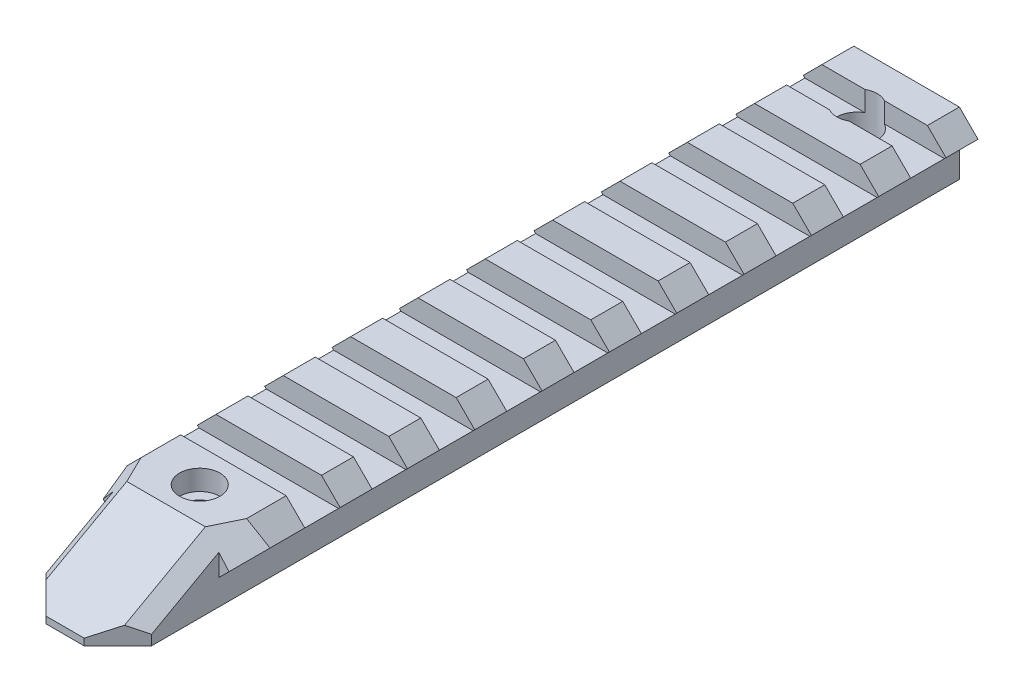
ISO-10303-21;
HEADER;
FILE_DESCRIPTION(('STEP AP214'),'2;1');
FILE_NAME('part.step','',(''),(''),'','','');
FILE_SCHEMA(('AUTOMOTIVE_DESIGN { 1 0 10303 214 1 1 1 1 }'));
ENDSEC;
DATA;
#1=APPLICATION_CONTEXT('core data for automotive mechanical design processes');
#2=APPLICATION_PROTOCOL_DEFINITION('international standard','automotive_design',2000,#1);
#3=PRODUCT_CONTEXT('',#1,'mechanical');
#4=PRODUCT('Part','Part','',(#3));
#5=PRODUCT_RELATED_PRODUCT_CATEGORY('part','',(#4));
#6=PRODUCT_DEFINITION_FORMATION('','',#4);
#7=PRODUCT_DEFINITION_CONTEXT('part definition',#1,'design');
#8=PRODUCT_DEFINITION('design','',#6,#7);
#9=PRODUCT_DEFINITION_SHAPE('','',#8);
#10=(LENGTH_UNIT() NAMED_UNIT(*) SI_UNIT(.MILLI.,.METRE.));
#11=(NAMED_UNIT(*) PLANE_ANGLE_UNIT() SI_UNIT($,.RADIAN.));
#12=(NAMED_UNIT(*) SI_UNIT($,.STERADIAN.) SOLID_ANGLE_UNIT());
#13=UNCERTAINTY_MEASURE_WITH_UNIT(LENGTH_MEASURE(1.E-05),#10,'distance_accuracy_value','');
#14=(GEOMETRIC_REPRESENTATION_CONTEXT(3) GLOBAL_UNCERTAINTY_ASSIGNED_CONTEXT((#13)) GLOBAL_UNIT_ASSIGNED_CONTEXT((#10,
#11,#12)) REPRESENTATION_CONTEXT('',''));
#15=CARTESIAN_POINT('',(0.,0.,0.));
#16=DIRECTION('',(0.,0.,1.));
#17=DIRECTION('',(1.,0.,0.));
#18=AXIS2_PLACEMENT_3D('',#15,#16,#17);
#19=CARTESIAN_POINT('',(0.,26.9695565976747,0.));
#20=DIRECTION('',(0.,1.,0.));
#21=DIRECTION('',(-1.,0.,0.));
#22=AXIS2_PLACEMENT_3D('',#19,#20,#21);
#23=PLANE('',#22);
#24=DIRECTION('',(-1.,0.,0.));
#25=VECTOR('',#24,1.);
#26=CARTESIAN_POINT('',(-28.7912438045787,26.9695565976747,4.75));
#27=LINE('',#26,#25);
#28=CARTESIAN_POINT('',(-7.82624380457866,26.9695565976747,4.75));
#29=VERTEX_POINT('',#28);
#30=CARTESIAN_POINT('',(-16.7388750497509,26.9695565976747,4.75));
#31=VERTEX_POINT('',#30);
#32=EDGE_CURVE('E641',#29,#31,#27,.T.);
#33=ORIENTED_EDGE('',*,*,#32,.T.);
#34=CARTESIAN_POINT('',(-18.1912438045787,26.9695565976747,7.375));
#35=DIRECTION('',(0.,1.,0.));
#36=DIRECTION('',(-1.,0.,0.));
#37=AXIS2_PLACEMENT_3D('',#34,#35,#36);
#38=CIRCLE('',#37,3.);
#39=CARTESIAN_POINT('',(-16.7388750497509,26.9695565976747,10.));
#40=VERTEX_POINT('',#39);
#41=EDGE_CURVE('E631',#31,#40,#38,.F.);
#42=ORIENTED_EDGE('',*,*,#41,.T.);
#43=DIRECTION('',(1.,0.,0.));
#44=VECTOR('',#43,1.);
#45=CARTESIAN_POINT('',(-28.7912438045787,26.9695565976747,10.));
#46=LINE('',#45,#44);
#47=CARTESIAN_POINT('',(-7.82624380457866,26.9695565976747,10.));
#48=VERTEX_POINT('',#47);
#49=EDGE_CURVE('E638',#40,#48,#46,.T.);
#50=ORIENTED_EDGE('',*,*,#49,.T.);
#51=DIRECTION('',(0.,0.,1.));
#52=VECTOR('',#51,1.);
#53=CARTESIAN_POINT('',(-7.82624380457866,26.9695565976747,110.));
#54=LINE('',#53,#52);
#55=EDGE_CURVE('E577',#29,#48,#54,.T.);
#56=ORIENTED_EDGE('',*,*,#55,.F.);
#57=EDGE_LOOP('',(#33,#42,#50,#56));
#58=FACE_BOUND('',#57,.T.);
#59=ADVANCED_FACE('F38',(#58),#23,.T.);
#60=CARTESIAN_POINT('',(-28.7912438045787,26.9695565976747,4.75));
#61=DIRECTION('',(0.,0.,-1.));
#62=DIRECTION('',(-1.,0.,0.));
#63=AXIS2_PLACEMENT_3D('',#60,#61,#62);
#64=PLANE('',#63);
#65=DIRECTION('',(0.,-1.,0.));
#66=VECTOR('',#65,1.);
#67=CARTESIAN_POINT('',(-16.7388750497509,29.9695565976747,4.75));
#68=LINE('',#67,#66);
#69=CARTESIAN_POINT('',(-16.7388750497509,29.9695565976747,4.75));
#70=VERTEX_POINT('',#69);
#71=EDGE_CURVE('E642',#31,#70,#68,.F.);
#72=ORIENTED_EDGE('',*,*,#71,.F.);
#73=ORIENTED_EDGE('',*,*,#32,.F.);
#74=DIRECTION('',(0.707106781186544,0.707106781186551,0.));
#75=VECTOR('',#74,1.);
#76=CARTESIAN_POINT('',(-17.3979002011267,17.3979002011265,4.75));
#77=LINE('',#76,#75);
#78=CARTESIAN_POINT('',(-7.59124380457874,27.2045565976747,4.75));
#79=VERTEX_POINT('',#78);
#80=EDGE_CURVE('E900',#29,#79,#77,.T.);
#81=ORIENTED_EDGE('',*,*,#80,.T.);
#82=DIRECTION('',(-0.707106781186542,0.707106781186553,0.));
#83=VECTOR('',#82,1.);
#84=CARTESIAN_POINT('',(9.80665639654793,9.80665639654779,4.75));
#85=LINE('',#84,#83);
#86=CARTESIAN_POINT('',(-10.3562438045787,29.9695565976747,4.75));
#87=VERTEX_POINT('',#86);
#88=EDGE_CURVE('E898',#79,#87,#85,.T.);
#89=ORIENTED_EDGE('',*,*,#88,.T.);
#90=DIRECTION('',(-1.,0.,0.));
#91=VECTOR('',#90,1.);
#92=CARTESIAN_POINT('',(0.,29.9695565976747,4.75));
#93=LINE('',#92,#91);
#94=EDGE_CURVE('E552',#87,#70,#93,.T.);
#95=ORIENTED_EDGE('',*,*,#94,.T.);
#96=EDGE_LOOP('',(#72,#73,#81,#89,#95));
#97=FACE_BOUND('',#96,.T.);
#98=ADVANCED_FACE('F1180',(#97),#64,.F.);
#99=DIRECTION('',(0.,-1.,0.));
#100=VECTOR('',#99,1.);
#101=CARTESIAN_POINT('',(-19.6436125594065,29.9695565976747,4.75));
#102=LINE('',#101,#100);
#103=CARTESIAN_POINT('',(-19.6436125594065,29.9695565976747,4.75));
#104=VERTEX_POINT('',#103);
#105=CARTESIAN_POINT('',(-19.6436125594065,26.9695565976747,4.75));
#106=VERTEX_POINT('',#105);
#107=EDGE_CURVE('E1182',#104,#106,#102,.T.);
#108=ORIENTED_EDGE('',*,*,#107,.F.);
#109=CARTESIAN_POINT('',(-26.0262438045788,29.9695565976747,4.75));
#110=VERTEX_POINT('',#109);
#111=EDGE_CURVE('E550',#104,#110,#93,.T.);
#112=ORIENTED_EDGE('',*,*,#111,.T.);
#113=DIRECTION('',(0.707106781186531,0.707106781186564,0.));
#114=VECTOR('',#113,1.);
#115=CARTESIAN_POINT('',(-27.9979002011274,27.9979002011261,4.75));
#116=LINE('',#115,#114);
#117=CARTESIAN_POINT('',(-28.7912438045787,27.2045565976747,4.75));
#118=VERTEX_POINT('',#117);
#119=EDGE_CURVE('E905',#118,#110,#116,.T.);
#120=ORIENTED_EDGE('',*,*,#119,.F.);
#121=DIRECTION('',(-0.707106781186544,0.707106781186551,0.));
#122=VECTOR('',#121,1.);
#123=CARTESIAN_POINT('',(-0.79334360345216,-0.793343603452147,4.75));
#124=LINE('',#123,#122);
#125=CARTESIAN_POINT('',(-28.5562438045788,26.9695565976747,4.75));
#126=VERTEX_POINT('',#125);
#127=EDGE_CURVE('E902',#126,#118,#124,.T.);
#128=ORIENTED_EDGE('',*,*,#127,.F.);
#129=EDGE_CURVE('E650',#106,#126,#27,.T.);
#130=ORIENTED_EDGE('',*,*,#129,.F.);
#131=EDGE_LOOP('',(#108,#112,#120,#128,#130));
#132=FACE_BOUND('',#131,.T.);
#133=ADVANCED_FACE('F1282',(#132),#64,.F.);
#134=CARTESIAN_POINT('',(-28.7912438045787,26.9695565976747,10.));
#135=DIRECTION('',(0.,0.,1.));
#136=DIRECTION('',(1.,0.,0.));
#137=AXIS2_PLACEMENT_3D('',#134,#135,#136);
#138=PLANE('',#137);
#139=DIRECTION('',(0.,-1.,0.));
#140=VECTOR('',#139,1.);
#141=CARTESIAN_POINT('',(-19.6436125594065,29.9695565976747,10.));
#142=LINE('',#141,#140);
#143=CARTESIAN_POINT('',(-19.6436125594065,26.9695565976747,10.));
#144=VERTEX_POINT('',#143);
#145=CARTESIAN_POINT('',(-19.6436125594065,29.9695565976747,10.));
#146=VERTEX_POINT('',#145);
#147=EDGE_CURVE('E11',#144,#146,#142,.F.);
#148=ORIENTED_EDGE('',*,*,#147,.F.);
#149=CARTESIAN_POINT('',(-28.5562438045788,26.9695565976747,10.));
#150=VERTEX_POINT('',#149);
#151=EDGE_CURVE('E647',#150,#144,#46,.T.);
#152=ORIENTED_EDGE('',*,*,#151,.F.);
#153=DIRECTION('',(0.707106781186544,-0.707106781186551,0.));
#154=VECTOR('',#153,1.);
#155=CARTESIAN_POINT('',(-0.793343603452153,-0.793343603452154,9.99999999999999));
#156=LINE('',#155,#154);
#157=CARTESIAN_POINT('',(-28.7912438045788,27.2045565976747,10.));
#158=VERTEX_POINT('',#157);
#159=EDGE_CURVE('E894',#158,#150,#156,.T.);
#160=ORIENTED_EDGE('',*,*,#159,.F.);
#161=DIRECTION('',(-0.707106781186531,-0.707106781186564,0.));
#162=VECTOR('',#161,1.);
#163=CARTESIAN_POINT('',(-27.9979002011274,27.9979002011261,9.99999999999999));
#164=LINE('',#163,#162);
#165=CARTESIAN_POINT('',(-26.0262438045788,29.9695565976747,9.99999999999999));
#166=VERTEX_POINT('',#165);
#167=EDGE_CURVE('E549',#166,#158,#164,.T.);
#168=ORIENTED_EDGE('',*,*,#167,.F.);
#169=DIRECTION('',(1.,0.,0.));
#170=VECTOR('',#169,1.);
#171=CARTESIAN_POINT('',(0.,29.9695565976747,9.99999999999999));
#172=LINE('',#171,#170);
#173=EDGE_CURVE('E540',#166,#146,#172,.T.);
#174=ORIENTED_EDGE('',*,*,#173,.T.);
#175=EDGE_LOOP('',(#148,#152,#160,#168,#174));
#176=FACE_BOUND('',#175,.T.);
#177=ADVANCED_FACE('F547',(#176),#138,.F.);
#178=DIRECTION('',(0.,-1.,0.));
#179=VECTOR('',#178,1.);
#180=CARTESIAN_POINT('',(-16.7388750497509,29.9695565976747,10.));
#181=LINE('',#180,#179);
#182=CARTESIAN_POINT('',(-16.7388750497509,29.9695565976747,9.99999999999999));
#183=VERTEX_POINT('',#182);
#184=EDGE_CURVE('E47',#183,#40,#181,.T.);
#185=ORIENTED_EDGE('',*,*,#184,.F.);
#186=CARTESIAN_POINT('',(-10.3562438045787,29.9695565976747,10.));
#187=VERTEX_POINT('',#186);
#188=EDGE_CURVE('E543',#183,#187,#172,.T.);
#189=ORIENTED_EDGE('',*,*,#188,.T.);
#190=DIRECTION('',(0.707106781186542,-0.707106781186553,0.));
#191=VECTOR('',#190,1.);
#192=CARTESIAN_POINT('',(9.80665639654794,9.80665639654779,9.99999999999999));
#193=LINE('',#192,#191);
#194=CARTESIAN_POINT('',(-7.59124380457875,27.2045565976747,10.));
#195=VERTEX_POINT('',#194);
#196=EDGE_CURVE('E891',#187,#195,#193,.T.);
#197=ORIENTED_EDGE('',*,*,#196,.T.);
#198=DIRECTION('',(-0.707106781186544,-0.707106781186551,0.));
#199=VECTOR('',#198,1.);
#200=CARTESIAN_POINT('',(-17.3979002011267,17.3979002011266,9.99999999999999));
#201=LINE('',#200,#199);
#202=EDGE_CURVE('E646',#195,#48,#201,.T.);
#203=ORIENTED_EDGE('',*,*,#202,.T.);
#204=ORIENTED_EDGE('',*,*,#49,.F.);
#205=EDGE_LOOP('',(#185,#189,#197,#203,#204));
#206=FACE_BOUND('',#205,.T.);
#207=ADVANCED_FACE('F644',(#206),#138,.F.);
#208=CARTESIAN_POINT('',(-18.1912438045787,20.6495565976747,7.375));
#209=DIRECTION('',(0.,1.,0.));
#210=DIRECTION('',(-1.,0.,0.));
#211=AXIS2_PLACEMENT_3D('',#208,#209,#210);
#212=CYLINDRICAL_SURFACE('',#211,1.65);
#213=CARTESIAN_POINT('',(-18.1912438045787,20.6495565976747,7.375));
#214=DIRECTION('',(0.,1.,0.));
#215=DIRECTION('',(-1.,0.,0.));
#216=AXIS2_PLACEMENT_3D('',#213,#214,#215);
#217=CIRCLE('',#216,1.65);
#218=CARTESIAN_POINT('',(-19.8412438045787,20.6495565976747,7.375));
#219=VERTEX_POINT('',#218);
#220=EDGE_CURVE('E1185',#219,#219,#217,.T.);
#221=ORIENTED_EDGE('',*,*,#220,.F.);
#222=EDGE_LOOP('',(#221));
#223=FACE_BOUND('',#222,.T.);
#224=CARTESIAN_POINT('',(-18.1912438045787,23.9695565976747,7.375));
#225=DIRECTION('',(0.,1.,0.));
#226=DIRECTION('',(-1.,0.,0.));
#227=AXIS2_PLACEMENT_3D('',#224,#225,#226);
#228=CIRCLE('',#227,1.65);
#229=CARTESIAN_POINT('',(-19.8412438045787,23.9695565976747,7.375));
#230=VERTEX_POINT('',#229);
#231=EDGE_CURVE('E544',#230,#230,#228,.F.);
#232=ORIENTED_EDGE('',*,*,#231,.F.);
#233=EDGE_LOOP('',(#232));
#234=FACE_BOUND('',#233,.T.);
#235=ADVANCED_FACE('F1273',(#223,#234),#212,.F.);
#236=CARTESIAN_POINT('',(0.,0.,110.));
#237=DIRECTION('',(0.,0.,1.));
#238=DIRECTION('',(1.,0.,0.));
#239=AXIS2_PLACEMENT_3D('',#236,#237,#238);
#240=PLANE('',#239);
#241=DIRECTION('',(0.,1.,0.));
#242=VECTOR('',#241,1.);
#243=CARTESIAN_POINT('',(-26.0262438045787,29.9695565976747,110.));
#244=LINE('',#243,#242);
#245=CARTESIAN_POINT('',(-26.0262438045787,24.4395565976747,110.));
#246=VERTEX_POINT('',#245);
#247=CARTESIAN_POINT('',(-26.0262438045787,27.6825016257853,110.));
#248=VERTEX_POINT('',#247);
#249=EDGE_CURVE('E580',#246,#248,#244,.T.);
#250=ORIENTED_EDGE('',*,*,#249,.T.);
#251=DIRECTION('',(0.65828589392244,0.752768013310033,0.));
#252=VECTOR('',#251,1.);
#253=CARTESIAN_POINT('',(-28.4657147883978,24.8928995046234,110.));
#254=LINE('',#253,#252);
#255=CARTESIAN_POINT('',(-27.5391448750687,25.9524576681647,110.));
#256=VERTEX_POINT('',#255);
#257=EDGE_CURVE('E625',#248,#256,#254,.F.);
#258=ORIENTED_EDGE('',*,*,#257,.T.);
#259=DIRECTION('',(0.707106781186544,-0.707106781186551,0.));
#260=VECTOR('',#259,1.);
#261=CARTESIAN_POINT('',(-0.793343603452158,-0.793343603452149,110.));
#262=LINE('',#261,#260);
#263=EDGE_CURVE('E938',#256,#246,#262,.T.);
#264=ORIENTED_EDGE('',*,*,#263,.T.);
#265=EDGE_LOOP('',(#250,#258,#264));
#266=FACE_BOUND('',#265,.T.);
#267=ADVANCED_FACE('F1265',(#266),#240,.T.);
#268=CARTESIAN_POINT('',(-27.9979002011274,27.9979002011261,110.));
#269=DIRECTION('',(0.707106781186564,-0.707106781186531,0.));
#270=DIRECTION('',(0.707106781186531,0.707106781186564,0.));
#271=AXIS2_PLACEMENT_3D('',#268,#269,#270);
#272=PLANE('',#271);
#273=DIRECTION('',(0.,0.,-1.));
#274=VECTOR('',#273,1.);
#275=CARTESIAN_POINT('',(-28.7912438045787,27.2045565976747,110.));
#276=LINE('',#275,#274);
#277=CARTESIAN_POINT('',(-28.7912438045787,27.2045565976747,0.));
#278=VERTEX_POINT('',#277);
#279=EDGE_CURVE('E988',#118,#278,#276,.T.);
#280=ORIENTED_EDGE('',*,*,#279,.F.);
#281=ORIENTED_EDGE('',*,*,#119,.T.);
#282=DIRECTION('',(0.,0.,-1.));
#283=VECTOR('',#282,1.);
#284=CARTESIAN_POINT('',(-26.0262438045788,29.9695565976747,110.));
#285=LINE('',#284,#283);
#286=CARTESIAN_POINT('',(-26.0262438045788,29.9695565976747,0.));
#287=VERTEX_POINT('',#286);
#288=EDGE_CURVE('E946',#110,#287,#285,.T.);
#289=ORIENTED_EDGE('',*,*,#288,.T.);
#290=DIRECTION('',(-0.707106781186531,-0.707106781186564,0.));
#291=VECTOR('',#290,1.);
#292=CARTESIAN_POINT('',(-27.9979002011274,27.9979002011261,0.));
#293=LINE('',#292,#291);
#294=EDGE_CURVE('E937',#287,#278,#293,.T.);
#295=ORIENTED_EDGE('',*,*,#294,.T.);
#296=EDGE_LOOP('',(#280,#281,#289,#295));
#297=FACE_BOUND('',#296,.T.);
#298=ADVANCED_FACE('F1046',(#297),#272,.F.);
#299=CARTESIAN_POINT('',(-26.0262438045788,29.9695565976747,14.75));
#300=VERTEX_POINT('',#299);
#301=EDGE_CURVE('E1036',#300,#166,#285,.T.);
#302=ORIENTED_EDGE('',*,*,#301,.T.);
#303=ORIENTED_EDGE('',*,*,#167,.T.);
#304=CARTESIAN_POINT('',(-28.7912438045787,27.2045565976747,14.75));
#305=VERTEX_POINT('',#304);
#306=EDGE_CURVE('E1038',#305,#158,#276,.T.);
#307=ORIENTED_EDGE('',*,*,#306,.F.);
#308=DIRECTION('',(0.707106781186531,0.707106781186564,0.));
#309=VECTOR('',#308,1.);
#310=CARTESIAN_POINT('',(-27.9979002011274,27.9979002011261,14.75));
#311=LINE('',#310,#309);
#312=EDGE_CURVE('E888',#305,#300,#311,.T.);
#313=ORIENTED_EDGE('',*,*,#312,.T.);
#314=EDGE_LOOP('',(#302,#303,#307,#313));
#315=FACE_BOUND('',#314,.T.);
#316=ADVANCED_FACE('F1035',(#315),#272,.F.);
#317=CARTESIAN_POINT('',(-26.0262438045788,29.9695565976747,24.75));
#318=VERTEX_POINT('',#317);
#319=CARTESIAN_POINT('',(-26.0262438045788,29.9695565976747,20.));
#320=VERTEX_POINT('',#319);
#321=EDGE_CURVE('E1039',#318,#320,#285,.T.);
#322=ORIENTED_EDGE('',*,*,#321,.T.);
#323=DIRECTION('',(-0.707106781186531,-0.707106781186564,0.));
#324=VECTOR('',#323,1.);
#325=CARTESIAN_POINT('',(-27.9979002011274,27.9979002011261,20.));
#326=LINE('',#325,#324);
#327=CARTESIAN_POINT('',(-28.7912438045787,27.2045565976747,20.));
#328=VERTEX_POINT('',#327);
#329=EDGE_CURVE('E878',#320,#328,#326,.T.);
#330=ORIENTED_EDGE('',*,*,#329,.T.);
#331=CARTESIAN_POINT('',(-28.7912438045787,27.2045565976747,24.75));
#332=VERTEX_POINT('',#331);
#333=EDGE_CURVE('E1092',#332,#328,#276,.T.);
#334=ORIENTED_EDGE('',*,*,#333,.F.);
#335=DIRECTION('',(0.707106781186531,0.707106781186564,0.));
#336=VECTOR('',#335,1.);
#337=CARTESIAN_POINT('',(-27.9979002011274,27.9979002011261,24.75));
#338=LINE('',#337,#336);
#339=EDGE_CURVE('E868',#332,#318,#338,.T.);
#340=ORIENTED_EDGE('',*,*,#339,.T.);
#341=EDGE_LOOP('',(#322,#330,#334,#340));
#342=FACE_BOUND('',#341,.T.);
#343=ADVANCED_FACE('F1827',(#342),#272,.F.);
#344=CARTESIAN_POINT('',(-26.0262438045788,29.9695565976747,34.75));
#345=VERTEX_POINT('',#344);
#346=CARTESIAN_POINT('',(-26.0262438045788,29.9695565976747,30.));
#347=VERTEX_POINT('',#346);
#348=EDGE_CURVE('E1041',#345,#347,#285,.T.);
#349=ORIENTED_EDGE('',*,*,#348,.T.);
#350=DIRECTION('',(-0.707106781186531,-0.707106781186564,0.));
#351=VECTOR('',#350,1.);
#352=CARTESIAN_POINT('',(-27.9979002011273,27.9979002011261,30.));
#353=LINE('',#352,#351);
#354=CARTESIAN_POINT('',(-28.7912438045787,27.2045565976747,30.));
#355=VERTEX_POINT('',#354);
#356=EDGE_CURVE('E858',#347,#355,#353,.T.);
#357=ORIENTED_EDGE('',*,*,#356,.T.);
#358=CARTESIAN_POINT('',(-28.7912438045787,27.2045565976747,34.75));
#359=VERTEX_POINT('',#358);
#360=EDGE_CURVE('E1094',#359,#355,#276,.T.);
#361=ORIENTED_EDGE('',*,*,#360,.F.);
#362=DIRECTION('',(0.707106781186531,0.707106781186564,0.));
#363=VECTOR('',#362,1.);
#364=CARTESIAN_POINT('',(-27.9979002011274,27.9979002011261,34.75));
#365=LINE('',#364,#363);
#366=EDGE_CURVE('E848',#359,#345,#365,.T.);
#367=ORIENTED_EDGE('',*,*,#366,.T.);
#368=EDGE_LOOP('',(#349,#357,#361,#367));
#369=FACE_BOUND('',#368,.T.);
#370=ADVANCED_FACE('F1834',(#369),#272,.F.);
#371=CARTESIAN_POINT('',(-26.0262438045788,29.9695565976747,44.75));
#372=VERTEX_POINT('',#371);
#373=CARTESIAN_POINT('',(-26.0262438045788,29.9695565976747,40.));
#374=VERTEX_POINT('',#373);
#375=EDGE_CURVE('E2017',#372,#374,#285,.T.);
#376=ORIENTED_EDGE('',*,*,#375,.T.);
#377=DIRECTION('',(-0.707106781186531,-0.707106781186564,0.));
#378=VECTOR('',#377,1.);
#379=CARTESIAN_POINT('',(-27.9979002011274,27.9979002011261,40.));
#380=LINE('',#379,#378);
#381=CARTESIAN_POINT('',(-28.7912438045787,27.2045565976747,40.));
#382=VERTEX_POINT('',#381);
#383=EDGE_CURVE('E838',#374,#382,#380,.T.);
#384=ORIENTED_EDGE('',*,*,#383,.T.);
#385=CARTESIAN_POINT('',(-28.7912438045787,27.2045565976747,44.75));
#386=VERTEX_POINT('',#385);
#387=EDGE_CURVE('E1097',#386,#382,#276,.T.);
#388=ORIENTED_EDGE('',*,*,#387,.F.);
#389=DIRECTION('',(0.707106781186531,0.707106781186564,0.));
#390=VECTOR('',#389,1.);
#391=CARTESIAN_POINT('',(-27.9979002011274,27.9979002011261,44.75));
#392=LINE('',#391,#390);
#393=EDGE_CURVE('E828',#386,#372,#392,.T.);
#394=ORIENTED_EDGE('',*,*,#393,.T.);
#395=EDGE_LOOP('',(#376,#384,#388,#394));
#396=FACE_BOUND('',#395,.T.);
#397=ADVANCED_FACE('F1842',(#396),#272,.F.);
#398=CARTESIAN_POINT('',(-26.0262438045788,29.9695565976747,54.75));
#399=VERTEX_POINT('',#398);
#400=CARTESIAN_POINT('',(-26.0262438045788,29.9695565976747,50.));
#401=VERTEX_POINT('',#400);
#402=EDGE_CURVE('E2014',#399,#401,#285,.T.);
#403=ORIENTED_EDGE('',*,*,#402,.T.);
#404=DIRECTION('',(-0.707106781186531,-0.707106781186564,0.));
#405=VECTOR('',#404,1.);
#406=CARTESIAN_POINT('',(-27.9979002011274,27.9979002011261,50.));
#407=LINE('',#406,#405);
#408=CARTESIAN_POINT('',(-28.7912438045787,27.2045565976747,50.));
#409=VERTEX_POINT('',#408);
#410=EDGE_CURVE('E818',#401,#409,#407,.T.);
#411=ORIENTED_EDGE('',*,*,#410,.T.);
#412=CARTESIAN_POINT('',(-28.7912438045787,27.2045565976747,54.75));
#413=VERTEX_POINT('',#412);
#414=EDGE_CURVE('E1100',#413,#409,#276,.T.);
#415=ORIENTED_EDGE('',*,*,#414,.F.);
#416=DIRECTION('',(0.707106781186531,0.707106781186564,0.));
#417=VECTOR('',#416,1.);
#418=CARTESIAN_POINT('',(-27.9979002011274,27.9979002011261,54.75));
#419=LINE('',#418,#417);
#420=EDGE_CURVE('E808',#413,#399,#419,.T.);
#421=ORIENTED_EDGE('',*,*,#420,.T.);
#422=EDGE_LOOP('',(#403,#411,#415,#421));
#423=FACE_BOUND('',#422,.T.);
#424=ADVANCED_FACE('F1850',(#423),#272,.F.);
#425=CARTESIAN_POINT('',(-26.0262438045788,29.9695565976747,64.75));
#426=VERTEX_POINT('',#425);
#427=CARTESIAN_POINT('',(-26.0262438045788,29.9695565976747,60.));
#428=VERTEX_POINT('',#427);
#429=EDGE_CURVE('E2011',#426,#428,#285,.T.);
#430=ORIENTED_EDGE('',*,*,#429,.T.);
#431=DIRECTION('',(-0.707106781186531,-0.707106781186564,0.));
#432=VECTOR('',#431,1.);
#433=CARTESIAN_POINT('',(-27.9979002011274,27.9979002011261,60.));
#434=LINE('',#433,#432);
#435=CARTESIAN_POINT('',(-28.7912438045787,27.2045565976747,60.));
#436=VERTEX_POINT('',#435);
#437=EDGE_CURVE('E798',#428,#436,#434,.T.);
#438=ORIENTED_EDGE('',*,*,#437,.T.);
#439=CARTESIAN_POINT('',(-28.7912438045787,27.2045565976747,64.75));
#440=VERTEX_POINT('',#439);
#441=EDGE_CURVE('E1103',#440,#436,#276,.T.);
#442=ORIENTED_EDGE('',*,*,#441,.F.);
#443=DIRECTION('',(0.707106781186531,0.707106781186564,0.));
#444=VECTOR('',#443,1.);
#445=CARTESIAN_POINT('',(-27.9979002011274,27.9979002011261,64.75));
#446=LINE('',#445,#444);
#447=EDGE_CURVE('E788',#440,#426,#446,.T.);
#448=ORIENTED_EDGE('',*,*,#447,.T.);
#449=EDGE_LOOP('',(#430,#438,#442,#448));
#450=FACE_BOUND('',#449,.T.);
#451=ADVANCED_FACE('F1858',(#450),#272,.F.);
#452=CARTESIAN_POINT('',(-26.0262438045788,29.9695565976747,74.75));
#453=VERTEX_POINT('',#452);
#454=CARTESIAN_POINT('',(-26.0262438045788,29.9695565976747,70.));
#455=VERTEX_POINT('',#454);
#456=EDGE_CURVE('E2009',#453,#455,#285,.T.);
#457=ORIENTED_EDGE('',*,*,#456,.T.);
#458=DIRECTION('',(-0.707106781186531,-0.707106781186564,0.));
#459=VECTOR('',#458,1.);
#460=CARTESIAN_POINT('',(-27.9979002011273,27.9979002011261,70.));
#461=LINE('',#460,#459);
#462=CARTESIAN_POINT('',(-28.7912438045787,27.2045565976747,70.));
#463=VERTEX_POINT('',#462);
#464=EDGE_CURVE('E778',#455,#463,#461,.T.);
#465=ORIENTED_EDGE('',*,*,#464,.T.);
#466=CARTESIAN_POINT('',(-28.7912438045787,27.2045565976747,74.75));
#467=VERTEX_POINT('',#466);
#468=EDGE_CURVE('E1106',#467,#463,#276,.T.);
#469=ORIENTED_EDGE('',*,*,#468,.F.);
#470=DIRECTION('',(0.707106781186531,0.707106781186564,0.));
#471=VECTOR('',#470,1.);
#472=CARTESIAN_POINT('',(-27.9979002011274,27.9979002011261,74.75));
#473=LINE('',#472,#471);
#474=EDGE_CURVE('E768',#467,#453,#473,.T.);
#475=ORIENTED_EDGE('',*,*,#474,.T.);
#476=EDGE_LOOP('',(#457,#465,#469,#475));
#477=FACE_BOUND('',#476,.T.);
#478=ADVANCED_FACE('F1866',(#477),#272,.F.);
#479=CARTESIAN_POINT('',(-26.0262438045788,29.9695565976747,84.75));
#480=VERTEX_POINT('',#479);
#481=CARTESIAN_POINT('',(-26.0262438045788,29.9695565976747,80.));
#482=VERTEX_POINT('',#481);
#483=EDGE_CURVE('E2006',#480,#482,#285,.T.);
#484=ORIENTED_EDGE('',*,*,#483,.T.);
#485=DIRECTION('',(-0.707106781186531,-0.707106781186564,0.));
#486=VECTOR('',#485,1.);
#487=CARTESIAN_POINT('',(-27.9979002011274,27.9979002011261,79.9999999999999));
#488=LINE('',#487,#486);
#489=CARTESIAN_POINT('',(-28.7912438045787,27.2045565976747,79.9999999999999));
#490=VERTEX_POINT('',#489);
#491=EDGE_CURVE('E758',#482,#490,#488,.T.);
#492=ORIENTED_EDGE('',*,*,#491,.T.);
#493=CARTESIAN_POINT('',(-28.7912438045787,27.2045565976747,84.75));
#494=VERTEX_POINT('',#493);
#495=EDGE_CURVE('E1109',#494,#490,#276,.T.);
#496=ORIENTED_EDGE('',*,*,#495,.F.);
#497=DIRECTION('',(0.707106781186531,0.707106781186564,0.));
#498=VECTOR('',#497,1.);
#499=CARTESIAN_POINT('',(-27.9979002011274,27.9979002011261,84.75));
#500=LINE('',#499,#498);
#501=EDGE_CURVE('E748',#494,#480,#500,.T.);
#502=ORIENTED_EDGE('',*,*,#501,.T.);
#503=EDGE_LOOP('',(#484,#492,#496,#502));
#504=FACE_BOUND('',#503,.T.);
#505=ADVANCED_FACE('F1874',(#504),#272,.F.);
#506=CARTESIAN_POINT('',(-26.0262438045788,29.9695565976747,94.7499999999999));
#507=VERTEX_POINT('',#506);
#508=CARTESIAN_POINT('',(-26.0262438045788,29.9695565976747,90.));
#509=VERTEX_POINT('',#508);
#510=EDGE_CURVE('E972',#507,#509,#285,.T.);
#511=ORIENTED_EDGE('',*,*,#510,.T.);
#512=DIRECTION('',(-0.707106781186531,-0.707106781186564,0.));
#513=VECTOR('',#512,1.);
#514=CARTESIAN_POINT('',(-27.9979002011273,27.9979002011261,89.9999999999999));
#515=LINE('',#514,#513);
#516=CARTESIAN_POINT('',(-28.7912438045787,27.2045565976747,89.9999999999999));
#517=VERTEX_POINT('',#516);
#518=EDGE_CURVE('E738',#509,#517,#515,.T.);
#519=ORIENTED_EDGE('',*,*,#518,.T.);
#520=CARTESIAN_POINT('',(-28.7912438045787,27.2045565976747,94.7499999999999));
#521=VERTEX_POINT('',#520);
#522=EDGE_CURVE('E992',#521,#517,#276,.T.);
#523=ORIENTED_EDGE('',*,*,#522,.F.);
#524=DIRECTION('',(0.707106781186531,0.707106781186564,0.));
#525=VECTOR('',#524,1.);
#526=CARTESIAN_POINT('',(-27.9979002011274,27.9979002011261,94.7499999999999));
#527=LINE('',#526,#525);
#528=EDGE_CURVE('E728',#521,#507,#527,.T.);
#529=ORIENTED_EDGE('',*,*,#528,.T.);
#530=EDGE_LOOP('',(#511,#519,#523,#529));
#531=FACE_BOUND('',#530,.T.);
#532=ADVANCED_FACE('F1117',(#531),#272,.F.);
#533=CARTESIAN_POINT('',(9.80665639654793,9.80665639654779,110.));
#534=DIRECTION('',(0.707106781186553,0.707106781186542,0.));
#535=DIRECTION('',(-0.707106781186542,0.707106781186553,0.));
#536=AXIS2_PLACEMENT_3D('',#533,#534,#535);
#537=PLANE('',#536);
#538=ORIENTED_EDGE('',*,*,#88,.F.);
#539=DIRECTION('',(0.,0.,-1.));
#540=VECTOR('',#539,1.);
#541=CARTESIAN_POINT('',(-7.59124380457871,27.2045565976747,110.));
#542=LINE('',#541,#540);
#543=CARTESIAN_POINT('',(-7.59124380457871,27.2045565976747,0.));
#544=VERTEX_POINT('',#543);
#545=EDGE_CURVE('E975',#79,#544,#542,.T.);
#546=ORIENTED_EDGE('',*,*,#545,.T.);
#547=DIRECTION('',(0.707106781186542,-0.707106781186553,0.));
#548=VECTOR('',#547,1.);
#549=CARTESIAN_POINT('',(9.80665639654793,9.80665639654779,0.));
#550=LINE('',#549,#548);
#551=CARTESIAN_POINT('',(-10.3562438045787,29.9695565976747,0.));
#552=VERTEX_POINT('',#551);
#553=EDGE_CURVE('E964',#552,#544,#550,.T.);
#554=ORIENTED_EDGE('',*,*,#553,.F.);
#555=DIRECTION('',(0.,0.,-1.));
#556=VECTOR('',#555,1.);
#557=CARTESIAN_POINT('',(-10.3562438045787,29.9695565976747,110.));
#558=LINE('',#557,#556);
#559=EDGE_CURVE('E971',#87,#552,#558,.T.);
#560=ORIENTED_EDGE('',*,*,#559,.F.);
#561=EDGE_LOOP('',(#538,#546,#554,#560));
#562=FACE_BOUND('',#561,.T.);
#563=ADVANCED_FACE('F1061',(#562),#537,.T.);
#564=ORIENTED_EDGE('',*,*,#196,.F.);
#565=CARTESIAN_POINT('',(-10.3562438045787,29.9695565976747,14.75));
#566=VERTEX_POINT('',#565);
#567=EDGE_CURVE('E1060',#566,#187,#558,.T.);
#568=ORIENTED_EDGE('',*,*,#567,.F.);
#569=DIRECTION('',(-0.707106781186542,0.707106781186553,0.));
#570=VECTOR('',#569,1.);
#571=CARTESIAN_POINT('',(9.80665639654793,9.80665639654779,14.75));
#572=LINE('',#571,#570);
#573=CARTESIAN_POINT('',(-7.59124380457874,27.2045565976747,14.75));
#574=VERTEX_POINT('',#573);
#575=EDGE_CURVE('E881',#574,#566,#572,.T.);
#576=ORIENTED_EDGE('',*,*,#575,.F.);
#577=EDGE_CURVE('E1177',#574,#195,#542,.T.);
#578=ORIENTED_EDGE('',*,*,#577,.T.);
#579=EDGE_LOOP('',(#564,#568,#576,#578));
#580=FACE_BOUND('',#579,.T.);
#581=ADVANCED_FACE('F1174',(#580),#537,.T.);
#582=DIRECTION('',(0.707106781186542,-0.707106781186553,0.));
#583=VECTOR('',#582,1.);
#584=CARTESIAN_POINT('',(9.80665639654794,9.80665639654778,20.));
#585=LINE('',#584,#583);
#586=CARTESIAN_POINT('',(-10.3562438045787,29.9695565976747,20.));
#587=VERTEX_POINT('',#586);
#588=CARTESIAN_POINT('',(-7.59124380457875,27.2045565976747,20.));
#589=VERTEX_POINT('',#588);
#590=EDGE_CURVE('E871',#587,#589,#585,.T.);
#591=ORIENTED_EDGE('',*,*,#590,.F.);
#592=CARTESIAN_POINT('',(-10.3562438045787,29.9695565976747,24.75));
#593=VERTEX_POINT('',#592);
#594=EDGE_CURVE('E1163',#593,#587,#558,.T.);
#595=ORIENTED_EDGE('',*,*,#594,.F.);
#596=DIRECTION('',(-0.707106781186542,0.707106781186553,0.));
#597=VECTOR('',#596,1.);
#598=CARTESIAN_POINT('',(9.80665639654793,9.80665639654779,24.75));
#599=LINE('',#598,#597);
#600=CARTESIAN_POINT('',(-7.59124380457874,27.2045565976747,24.75));
#601=VERTEX_POINT('',#600);
#602=EDGE_CURVE('E861',#601,#593,#599,.T.);
#603=ORIENTED_EDGE('',*,*,#602,.F.);
#604=EDGE_CURVE('E2031',#601,#589,#542,.T.);
#605=ORIENTED_EDGE('',*,*,#604,.T.);
#606=EDGE_LOOP('',(#591,#595,#603,#605));
#607=FACE_BOUND('',#606,.T.);
#608=ADVANCED_FACE('F1901',(#607),#537,.T.);
#609=DIRECTION('',(0.707106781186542,-0.707106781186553,0.));
#610=VECTOR('',#609,1.);
#611=CARTESIAN_POINT('',(9.80665639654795,9.80665639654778,30.));
#612=LINE('',#611,#610);
#613=CARTESIAN_POINT('',(-10.3562438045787,29.9695565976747,30.));
#614=VERTEX_POINT('',#613);
#615=CARTESIAN_POINT('',(-7.59124380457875,27.2045565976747,30.));
#616=VERTEX_POINT('',#615);
#617=EDGE_CURVE('E851',#614,#616,#612,.T.);
#618=ORIENTED_EDGE('',*,*,#617,.F.);
#619=CARTESIAN_POINT('',(-10.3562438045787,29.9695565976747,34.75));
#620=VERTEX_POINT('',#619);
#621=EDGE_CURVE('E1157',#620,#614,#558,.T.);
#622=ORIENTED_EDGE('',*,*,#621,.F.);
#623=DIRECTION('',(-0.707106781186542,0.707106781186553,0.));
#624=VECTOR('',#623,1.);
#625=CARTESIAN_POINT('',(9.80665639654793,9.80665639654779,34.75));
#626=LINE('',#625,#624);
#627=CARTESIAN_POINT('',(-7.59124380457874,27.2045565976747,34.75));
#628=VERTEX_POINT('',#627);
#629=EDGE_CURVE('E841',#628,#620,#626,.T.);
#630=ORIENTED_EDGE('',*,*,#629,.F.);
#631=EDGE_CURVE('E2028',#628,#616,#542,.T.);
#632=ORIENTED_EDGE('',*,*,#631,.T.);
#633=EDGE_LOOP('',(#618,#622,#630,#632));
#634=FACE_BOUND('',#633,.T.);
#635=ADVANCED_FACE('F1908',(#634),#537,.T.);
#636=DIRECTION('',(0.707106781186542,-0.707106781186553,0.));
#637=VECTOR('',#636,1.);
#638=CARTESIAN_POINT('',(9.80665639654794,9.80665639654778,40.));
#639=LINE('',#638,#637);
#640=CARTESIAN_POINT('',(-10.3562438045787,29.9695565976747,40.));
#641=VERTEX_POINT('',#640);
#642=CARTESIAN_POINT('',(-7.59124380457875,27.2045565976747,40.));
#643=VERTEX_POINT('',#642);
#644=EDGE_CURVE('E831',#641,#643,#639,.T.);
#645=ORIENTED_EDGE('',*,*,#644,.F.);
#646=CARTESIAN_POINT('',(-10.3562438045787,29.9695565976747,44.75));
#647=VERTEX_POINT('',#646);
#648=EDGE_CURVE('E1151',#647,#641,#558,.T.);
#649=ORIENTED_EDGE('',*,*,#648,.F.);
#650=DIRECTION('',(-0.707106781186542,0.707106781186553,0.));
#651=VECTOR('',#650,1.);
#652=CARTESIAN_POINT('',(9.80665639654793,9.80665639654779,44.75));
#653=LINE('',#652,#651);
#654=CARTESIAN_POINT('',(-7.59124380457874,27.2045565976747,44.75));
#655=VERTEX_POINT('',#654);
#656=EDGE_CURVE('E821',#655,#647,#653,.T.);
#657=ORIENTED_EDGE('',*,*,#656,.F.);
#658=EDGE_CURVE('E2030',#655,#643,#542,.T.);
#659=ORIENTED_EDGE('',*,*,#658,.T.);
#660=EDGE_LOOP('',(#645,#649,#657,#659));
#661=FACE_BOUND('',#660,.T.);
#662=ADVANCED_FACE('F1916',(#661),#537,.T.);
#663=DIRECTION('',(0.707106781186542,-0.707106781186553,0.));
#664=VECTOR('',#663,1.);
#665=CARTESIAN_POINT('',(9.80665639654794,9.80665639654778,50.));
#666=LINE('',#665,#664);
#667=CARTESIAN_POINT('',(-10.3562438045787,29.9695565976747,50.));
#668=VERTEX_POINT('',#667);
#669=CARTESIAN_POINT('',(-7.59124380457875,27.2045565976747,50.));
#670=VERTEX_POINT('',#669);
#671=EDGE_CURVE('E811',#668,#670,#666,.T.);
#672=ORIENTED_EDGE('',*,*,#671,.F.);
#673=CARTESIAN_POINT('',(-10.3562438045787,29.9695565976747,54.75));
#674=VERTEX_POINT('',#673);
#675=EDGE_CURVE('E1145',#674,#668,#558,.T.);
#676=ORIENTED_EDGE('',*,*,#675,.F.);
#677=DIRECTION('',(-0.707106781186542,0.707106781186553,0.));
#678=VECTOR('',#677,1.);
#679=CARTESIAN_POINT('',(9.80665639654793,9.80665639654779,54.75));
#680=LINE('',#679,#678);
#681=CARTESIAN_POINT('',(-7.59124380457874,27.2045565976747,54.75));
#682=VERTEX_POINT('',#681);
#683=EDGE_CURVE('E801',#682,#674,#680,.T.);
#684=ORIENTED_EDGE('',*,*,#683,.F.);
#685=EDGE_CURVE('E2033',#682,#670,#542,.T.);
#686=ORIENTED_EDGE('',*,*,#685,.T.);
#687=EDGE_LOOP('',(#672,#676,#684,#686));
#688=FACE_BOUND('',#687,.T.);
#689=ADVANCED_FACE('F1924',(#688),#537,.T.);
#690=DIRECTION('',(0.707106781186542,-0.707106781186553,0.));
#691=VECTOR('',#690,1.);
#692=CARTESIAN_POINT('',(9.80665639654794,9.80665639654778,60.));
#693=LINE('',#692,#691);
#694=CARTESIAN_POINT('',(-10.3562438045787,29.9695565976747,60.));
#695=VERTEX_POINT('',#694);
#696=CARTESIAN_POINT('',(-7.59124380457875,27.2045565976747,60.));
#697=VERTEX_POINT('',#696);
#698=EDGE_CURVE('E791',#695,#697,#693,.T.);
#699=ORIENTED_EDGE('',*,*,#698,.F.);
#700=CARTESIAN_POINT('',(-10.3562438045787,29.9695565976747,64.75));
#701=VERTEX_POINT('',#700);
#702=EDGE_CURVE('E1139',#701,#695,#558,.T.);
#703=ORIENTED_EDGE('',*,*,#702,.F.);
#704=DIRECTION('',(-0.707106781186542,0.707106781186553,0.));
#705=VECTOR('',#704,1.);
#706=CARTESIAN_POINT('',(9.80665639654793,9.80665639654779,64.75));
#707=LINE('',#706,#705);
#708=CARTESIAN_POINT('',(-7.59124380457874,27.2045565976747,64.75));
#709=VERTEX_POINT('',#708);
#710=EDGE_CURVE('E781',#709,#701,#707,.T.);
#711=ORIENTED_EDGE('',*,*,#710,.F.);
#712=EDGE_CURVE('E2050',#709,#697,#542,.T.);
#713=ORIENTED_EDGE('',*,*,#712,.T.);
#714=EDGE_LOOP('',(#699,#703,#711,#713));
#715=FACE_BOUND('',#714,.T.);
#716=ADVANCED_FACE('F1932',(#715),#537,.T.);
#717=DIRECTION('',(0.707106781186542,-0.707106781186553,0.));
#718=VECTOR('',#717,1.);
#719=CARTESIAN_POINT('',(9.80665639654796,9.80665639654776,70.));
#720=LINE('',#719,#718);
#721=CARTESIAN_POINT('',(-10.3562438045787,29.9695565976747,70.));
#722=VERTEX_POINT('',#721);
#723=CARTESIAN_POINT('',(-7.59124380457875,27.2045565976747,70.));
#724=VERTEX_POINT('',#723);
#725=EDGE_CURVE('E771',#722,#724,#720,.T.);
#726=ORIENTED_EDGE('',*,*,#725,.F.);
#727=CARTESIAN_POINT('',(-10.3562438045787,29.9695565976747,74.75));
#728=VERTEX_POINT('',#727);
#729=EDGE_CURVE('E1133',#728,#722,#558,.T.);
#730=ORIENTED_EDGE('',*,*,#729,.F.);
#731=DIRECTION('',(-0.707106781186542,0.707106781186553,0.));
#732=VECTOR('',#731,1.);
#733=CARTESIAN_POINT('',(9.80665639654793,9.80665639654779,74.75));
#734=LINE('',#733,#732);
#735=CARTESIAN_POINT('',(-7.59124380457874,27.2045565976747,74.75));
#736=VERTEX_POINT('',#735);
#737=EDGE_CURVE('E761',#736,#728,#734,.T.);
#738=ORIENTED_EDGE('',*,*,#737,.F.);
#739=EDGE_CURVE('E2055',#736,#724,#542,.T.);
#740=ORIENTED_EDGE('',*,*,#739,.T.);
#741=EDGE_LOOP('',(#726,#730,#738,#740));
#742=FACE_BOUND('',#741,.T.);
#743=ADVANCED_FACE('F1940',(#742),#537,.T.);
#744=DIRECTION('',(0.707106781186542,-0.707106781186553,0.));
#745=VECTOR('',#744,1.);
#746=CARTESIAN_POINT('',(9.80665639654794,9.80665639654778,80.));
#747=LINE('',#746,#745);
#748=CARTESIAN_POINT('',(-10.3562438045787,29.9695565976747,80.));
#749=VERTEX_POINT('',#748);
#750=CARTESIAN_POINT('',(-7.59124380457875,27.2045565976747,80.));
#751=VERTEX_POINT('',#750);
#752=EDGE_CURVE('E751',#749,#751,#747,.T.);
#753=ORIENTED_EDGE('',*,*,#752,.F.);
#754=CARTESIAN_POINT('',(-10.3562438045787,29.9695565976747,84.75));
#755=VERTEX_POINT('',#754);
#756=EDGE_CURVE('E1131',#755,#749,#558,.T.);
#757=ORIENTED_EDGE('',*,*,#756,.F.);
#758=DIRECTION('',(-0.707106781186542,0.707106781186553,0.));
#759=VECTOR('',#758,1.);
#760=CARTESIAN_POINT('',(9.80665639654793,9.80665639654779,84.75));
#761=LINE('',#760,#759);
#762=CARTESIAN_POINT('',(-7.59124380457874,27.2045565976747,84.75));
#763=VERTEX_POINT('',#762);
#764=EDGE_CURVE('E741',#763,#755,#761,.T.);
#765=ORIENTED_EDGE('',*,*,#764,.F.);
#766=EDGE_CURVE('E2060',#763,#751,#542,.T.);
#767=ORIENTED_EDGE('',*,*,#766,.T.);
#768=EDGE_LOOP('',(#753,#757,#765,#767));
#769=FACE_BOUND('',#768,.T.);
#770=ADVANCED_FACE('F1948',(#769),#537,.T.);
#771=DIRECTION('',(0.707106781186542,-0.707106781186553,0.));
#772=VECTOR('',#771,1.);
#773=CARTESIAN_POINT('',(9.80665639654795,9.80665639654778,90.));
#774=LINE('',#773,#772);
#775=CARTESIAN_POINT('',(-10.3562438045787,29.9695565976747,90.));
#776=VERTEX_POINT('',#775);
#777=CARTESIAN_POINT('',(-7.59124380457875,27.2045565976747,90.));
#778=VERTEX_POINT('',#777);
#779=EDGE_CURVE('E731',#776,#778,#774,.T.);
#780=ORIENTED_EDGE('',*,*,#779,.F.);
#781=CARTESIAN_POINT('',(-10.3562438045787,29.9695565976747,94.7499999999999));
#782=VERTEX_POINT('',#781);
#783=EDGE_CURVE('E976',#782,#776,#558,.T.);
#784=ORIENTED_EDGE('',*,*,#783,.F.);
#785=DIRECTION('',(-0.707106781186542,0.707106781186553,0.));
#786=VECTOR('',#785,1.);
#787=CARTESIAN_POINT('',(9.80665639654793,9.80665639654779,94.7499999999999));
#788=LINE('',#787,#786);
#789=CARTESIAN_POINT('',(-7.59124380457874,27.2045565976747,94.7499999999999));
#790=VERTEX_POINT('',#789);
#791=EDGE_CURVE('E721',#790,#782,#788,.T.);
#792=ORIENTED_EDGE('',*,*,#791,.F.);
#793=EDGE_CURVE('E980',#790,#778,#542,.T.);
#794=ORIENTED_EDGE('',*,*,#793,.T.);
#795=EDGE_LOOP('',(#780,#784,#792,#794));
#796=FACE_BOUND('',#795,.T.);
#797=ADVANCED_FACE('F1436',(#796),#537,.T.);
#798=CARTESIAN_POINT('',(0.,29.9695565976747,110.));
#799=DIRECTION('',(0.,1.,0.));
#800=DIRECTION('',(-1.,0.,0.));
#801=AXIS2_PLACEMENT_3D('',#798,#799,#800);
#802=PLANE('',#801);
#803=ORIENTED_EDGE('',*,*,#111,.F.);
#804=CARTESIAN_POINT('',(-18.1912438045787,29.9695565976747,7.375));
#805=DIRECTION('',(0.,1.,0.));
#806=DIRECTION('',(-1.,0.,0.));
#807=AXIS2_PLACEMENT_3D('',#804,#805,#806);
#808=CIRCLE('',#807,3.);
#809=EDGE_CURVE('E545',#70,#104,#808,.T.);
#810=ORIENTED_EDGE('',*,*,#809,.F.);
#811=ORIENTED_EDGE('',*,*,#94,.F.);
#812=ORIENTED_EDGE('',*,*,#559,.T.);
#813=DIRECTION('',(1.,0.,0.));
#814=VECTOR('',#813,1.);
#815=CARTESIAN_POINT('',(0.,29.9695565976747,0.));
#816=LINE('',#815,#814);
#817=EDGE_CURVE('E941',#287,#552,#816,.T.);
#818=ORIENTED_EDGE('',*,*,#817,.F.);
#819=ORIENTED_EDGE('',*,*,#288,.F.);
#820=EDGE_LOOP('',(#803,#810,#811,#812,#818,#819));
#821=FACE_BOUND('',#820,.T.);
#822=ADVANCED_FACE('F1053',(#821),#802,.T.);
#823=ORIENTED_EDGE('',*,*,#188,.F.);
#824=EDGE_CURVE('E53',#146,#183,#808,.T.);
#825=ORIENTED_EDGE('',*,*,#824,.F.);
#826=ORIENTED_EDGE('',*,*,#173,.F.);
#827=ORIENTED_EDGE('',*,*,#301,.F.);
#828=DIRECTION('',(-1.,0.,0.));
#829=VECTOR('',#828,1.);
#830=CARTESIAN_POINT('',(0.,29.9695565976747,14.75));
#831=LINE('',#830,#829);
#832=EDGE_CURVE('E554',#566,#300,#831,.T.);
#833=ORIENTED_EDGE('',*,*,#832,.F.);
#834=ORIENTED_EDGE('',*,*,#567,.T.);
#835=EDGE_LOOP('',(#823,#825,#826,#827,#833,#834));
#836=FACE_BOUND('',#835,.T.);
#837=ADVANCED_FACE('F538',(#836),#802,.T.);
#838=DIRECTION('',(1.,0.,0.));
#839=VECTOR('',#838,1.);
#840=CARTESIAN_POINT('',(0.,29.9695565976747,20.));
#841=LINE('',#840,#839);
#842=EDGE_CURVE('E1024',#320,#587,#841,.T.);
#843=ORIENTED_EDGE('',*,*,#842,.F.);
#844=ORIENTED_EDGE('',*,*,#321,.F.);
#845=DIRECTION('',(-1.,0.,0.));
#846=VECTOR('',#845,1.);
#847=CARTESIAN_POINT('',(0.,29.9695565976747,24.75));
#848=LINE('',#847,#846);
#849=EDGE_CURVE('E1023',#593,#318,#848,.T.);
#850=ORIENTED_EDGE('',*,*,#849,.F.);
#851=ORIENTED_EDGE('',*,*,#594,.T.);
#852=EDGE_LOOP('',(#843,#844,#850,#851));
#853=FACE_BOUND('',#852,.T.);
#854=ADVANCED_FACE('F1442',(#853),#802,.T.);
#855=DIRECTION('',(1.,0.,0.));
#856=VECTOR('',#855,1.);
#857=CARTESIAN_POINT('',(0.,29.9695565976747,30.));
#858=LINE('',#857,#856);
#859=EDGE_CURVE('E1021',#347,#614,#858,.T.);
#860=ORIENTED_EDGE('',*,*,#859,.F.);
#861=ORIENTED_EDGE('',*,*,#348,.F.);
#862=DIRECTION('',(-1.,0.,0.));
#863=VECTOR('',#862,1.);
#864=CARTESIAN_POINT('',(0.,29.9695565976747,34.75));
#865=LINE('',#864,#863);
#866=EDGE_CURVE('E1019',#620,#345,#865,.T.);
#867=ORIENTED_EDGE('',*,*,#866,.F.);
#868=ORIENTED_EDGE('',*,*,#621,.T.);
#869=EDGE_LOOP('',(#860,#861,#867,#868));
#870=FACE_BOUND('',#869,.T.);
#871=ADVANCED_FACE('F1453',(#870),#802,.T.);
#872=DIRECTION('',(1.,0.,0.));
#873=VECTOR('',#872,1.);
#874=CARTESIAN_POINT('',(0.,29.9695565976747,40.));
#875=LINE('',#874,#873);
#876=EDGE_CURVE('E1017',#374,#641,#875,.T.);
#877=ORIENTED_EDGE('',*,*,#876,.F.);
#878=ORIENTED_EDGE('',*,*,#375,.F.);
#879=DIRECTION('',(-1.,0.,0.));
#880=VECTOR('',#879,1.);
#881=CARTESIAN_POINT('',(0.,29.9695565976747,44.75));
#882=LINE('',#881,#880);
#883=EDGE_CURVE('E1015',#647,#372,#882,.T.);
#884=ORIENTED_EDGE('',*,*,#883,.F.);
#885=ORIENTED_EDGE('',*,*,#648,.T.);
#886=EDGE_LOOP('',(#877,#878,#884,#885));
#887=FACE_BOUND('',#886,.T.);
#888=ADVANCED_FACE('F1460',(#887),#802,.T.);
#889=DIRECTION('',(1.,0.,0.));
#890=VECTOR('',#889,1.);
#891=CARTESIAN_POINT('',(0.,29.9695565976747,50.));
#892=LINE('',#891,#890);
#893=EDGE_CURVE('E1013',#401,#668,#892,.T.);
#894=ORIENTED_EDGE('',*,*,#893,.F.);
#895=ORIENTED_EDGE('',*,*,#402,.F.);
#896=DIRECTION('',(-1.,0.,0.));
#897=VECTOR('',#896,1.);
#898=CARTESIAN_POINT('',(0.,29.9695565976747,54.75));
#899=LINE('',#898,#897);
#900=EDGE_CURVE('E1011',#674,#399,#899,.T.);
#901=ORIENTED_EDGE('',*,*,#900,.F.);
#902=ORIENTED_EDGE('',*,*,#675,.T.);
#903=EDGE_LOOP('',(#894,#895,#901,#902));
#904=FACE_BOUND('',#903,.T.);
#905=ADVANCED_FACE('F1466',(#904),#802,.T.);
#906=DIRECTION('',(1.,0.,0.));
#907=VECTOR('',#906,1.);
#908=CARTESIAN_POINT('',(0.,29.9695565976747,60.));
#909=LINE('',#908,#907);
#910=EDGE_CURVE('E1009',#428,#695,#909,.T.);
#911=ORIENTED_EDGE('',*,*,#910,.F.);
#912=ORIENTED_EDGE('',*,*,#429,.F.);
#913=DIRECTION('',(-1.,0.,0.));
#914=VECTOR('',#913,1.);
#915=CARTESIAN_POINT('',(0.,29.9695565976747,64.75));
#916=LINE('',#915,#914);
#917=EDGE_CURVE('E1007',#701,#426,#916,.T.);
#918=ORIENTED_EDGE('',*,*,#917,.F.);
#919=ORIENTED_EDGE('',*,*,#702,.T.);
#920=EDGE_LOOP('',(#911,#912,#918,#919));
#921=FACE_BOUND('',#920,.T.);
#922=ADVANCED_FACE('F1472',(#921),#802,.T.);
#923=DIRECTION('',(1.,0.,0.));
#924=VECTOR('',#923,1.);
#925=CARTESIAN_POINT('',(0.,29.9695565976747,70.));
#926=LINE('',#925,#924);
#927=EDGE_CURVE('E1005',#455,#722,#926,.T.);
#928=ORIENTED_EDGE('',*,*,#927,.F.);
#929=ORIENTED_EDGE('',*,*,#456,.F.);
#930=DIRECTION('',(-1.,0.,0.));
#931=VECTOR('',#930,1.);
#932=CARTESIAN_POINT('',(0.,29.9695565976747,74.75));
#933=LINE('',#932,#931);
#934=EDGE_CURVE('E1003',#728,#453,#933,.T.);
#935=ORIENTED_EDGE('',*,*,#934,.F.);
#936=ORIENTED_EDGE('',*,*,#729,.T.);
#937=EDGE_LOOP('',(#928,#929,#935,#936));
#938=FACE_BOUND('',#937,.T.);
#939=ADVANCED_FACE('F1478',(#938),#802,.T.);
#940=DIRECTION('',(1.,0.,0.));
#941=VECTOR('',#940,1.);
#942=CARTESIAN_POINT('',(0.,29.9695565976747,80.));
#943=LINE('',#942,#941);
#944=EDGE_CURVE('E1001',#482,#749,#943,.T.);
#945=ORIENTED_EDGE('',*,*,#944,.F.);
#946=ORIENTED_EDGE('',*,*,#483,.F.);
#947=DIRECTION('',(-1.,0.,0.));
#948=VECTOR('',#947,1.);
#949=CARTESIAN_POINT('',(0.,29.9695565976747,84.75));
#950=LINE('',#949,#948);
#951=EDGE_CURVE('E999',#755,#480,#950,.T.);
#952=ORIENTED_EDGE('',*,*,#951,.F.);
#953=ORIENTED_EDGE('',*,*,#756,.T.);
#954=EDGE_LOOP('',(#945,#946,#952,#953));
#955=FACE_BOUND('',#954,.T.);
#956=ADVANCED_FACE('F1484',(#955),#802,.T.);
#957=DIRECTION('',(1.,0.,0.));
#958=VECTOR('',#957,1.);
#959=CARTESIAN_POINT('',(0.,29.9695565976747,90.));
#960=LINE('',#959,#958);
#961=EDGE_CURVE('E997',#509,#776,#960,.T.);
#962=ORIENTED_EDGE('',*,*,#961,.F.);
#963=ORIENTED_EDGE('',*,*,#510,.F.);
#964=DIRECTION('',(-1.,0.,0.));
#965=VECTOR('',#964,1.);
#966=CARTESIAN_POINT('',(0.,29.9695565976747,94.7499999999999));
#967=LINE('',#966,#965);
#968=EDGE_CURVE('E995',#782,#507,#967,.T.);
#969=ORIENTED_EDGE('',*,*,#968,.F.);
#970=ORIENTED_EDGE('',*,*,#783,.T.);
#971=EDGE_LOOP('',(#962,#963,#969,#970));
#972=FACE_BOUND('',#971,.T.);
#973=ADVANCED_FACE('F1126',(#972),#802,.T.);
#974=CARTESIAN_POINT('',(-28.7912438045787,27.2045565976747,105.161222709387));
#975=VERTEX_POINT('',#974);
#976=CARTESIAN_POINT('',(-28.7912438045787,27.2045565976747,99.9999999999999));
#977=VERTEX_POINT('',#976);
#978=EDGE_CURVE('E989',#975,#977,#276,.T.);
#979=ORIENTED_EDGE('',*,*,#978,.F.);
#980=DIRECTION('',(-0.695559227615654,-0.695559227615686,-0.179985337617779));
#981=VECTOR('',#980,1.);
#982=CARTESIAN_POINT('',(-26.6898221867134,29.3059782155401,105.704993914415));
#983=LINE('',#982,#981);
#984=CARTESIAN_POINT('',(-26.0262438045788,29.9695565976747,105.876703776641));
#985=VERTEX_POINT('',#984);
#986=EDGE_CURVE('E628',#975,#985,#983,.F.);
#987=ORIENTED_EDGE('',*,*,#986,.T.);
#988=CARTESIAN_POINT('',(-26.0262438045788,29.9695565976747,99.9999999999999));
#989=VERTEX_POINT('',#988);
#990=EDGE_CURVE('E969',#985,#989,#285,.T.);
#991=ORIENTED_EDGE('',*,*,#990,.T.);
#992=DIRECTION('',(-0.707106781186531,-0.707106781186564,0.));
#993=VECTOR('',#992,1.);
#994=CARTESIAN_POINT('',(-27.9979002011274,27.9979002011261,99.9999999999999));
#995=LINE('',#994,#993);
#996=EDGE_CURVE('E718',#989,#977,#995,.T.);
#997=ORIENTED_EDGE('',*,*,#996,.T.);
#998=EDGE_LOOP('',(#979,#987,#991,#997));
#999=FACE_BOUND('',#998,.T.);
#1000=ADVANCED_FACE('F1243',(#999),#272,.F.);
#1001=CARTESIAN_POINT('',(-0.793343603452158,-0.793343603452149,110.));
#1002=DIRECTION('',(0.707106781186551,0.707106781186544,0.));
#1003=DIRECTION('',(-0.707106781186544,0.707106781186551,0.));
#1004=AXIS2_PLACEMENT_3D('',#1001,#1002,#1003);
#1005=PLANE('',#1004);
#1006=ORIENTED_EDGE('',*,*,#263,.F.);
#1007=DIRECTION('',(0.243003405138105,-0.243003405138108,0.93909461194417));
#1008=VECTOR('',#1007,1.);
#1009=CARTESIAN_POINT('',(-23.6545688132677,22.0678816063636,125.012071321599));
#1010=LINE('',#1009,#1008);
#1011=EDGE_CURVE('E61',#256,#975,#1010,.F.);
#1012=ORIENTED_EDGE('',*,*,#1011,.T.);
#1013=ORIENTED_EDGE('',*,*,#978,.T.);
#1014=DIRECTION('',(0.707106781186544,-0.707106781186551,0.));
#1015=VECTOR('',#1014,1.);
#1016=CARTESIAN_POINT('',(-0.793343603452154,-0.793343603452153,99.9999999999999));
#1017=LINE('',#1016,#1015);
#1018=CARTESIAN_POINT('',(-28.5562438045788,26.9695565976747,99.9999999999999));
#1019=VERTEX_POINT('',#1018);
#1020=EDGE_CURVE('E715',#977,#1019,#1017,.T.);
#1021=ORIENTED_EDGE('',*,*,#1020,.T.);
#1022=DIRECTION('',(0.,0.,-1.));
#1023=VECTOR('',#1022,1.);
#1024=CARTESIAN_POINT('',(-28.5562438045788,26.9695565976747,110.));
#1025=LINE('',#1024,#1023);
#1026=CARTESIAN_POINT('',(-28.5562438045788,26.9695565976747,94.7499999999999));
#1027=VERTEX_POINT('',#1026);
#1028=EDGE_CURVE('E908',#1019,#1027,#1025,.T.);
#1029=ORIENTED_EDGE('',*,*,#1028,.T.);
#1030=DIRECTION('',(-0.707106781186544,0.707106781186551,0.));
#1031=VECTOR('',#1030,1.);
#1032=CARTESIAN_POINT('',(-0.793343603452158,-0.793343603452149,94.7499999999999));
#1033=LINE('',#1032,#1031);
#1034=EDGE_CURVE('E725',#1027,#521,#1033,.T.);
#1035=ORIENTED_EDGE('',*,*,#1034,.T.);
#1036=ORIENTED_EDGE('',*,*,#522,.T.);
#1037=DIRECTION('',(0.707106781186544,-0.707106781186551,0.));
#1038=VECTOR('',#1037,1.);
#1039=CARTESIAN_POINT('',(-0.793343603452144,-0.793343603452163,90.));
#1040=LINE('',#1039,#1038);
#1041=CARTESIAN_POINT('',(-28.5562438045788,26.9695565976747,89.9999999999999));
#1042=VERTEX_POINT('',#1041);
#1043=EDGE_CURVE('E735',#517,#1042,#1040,.T.);
#1044=ORIENTED_EDGE('',*,*,#1043,.T.);
#1045=DIRECTION('',(0.,0.,-1.));
#1046=VECTOR('',#1045,1.);
#1047=CARTESIAN_POINT('',(-28.5562438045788,26.9695565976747,110.));
#1048=LINE('',#1047,#1046);
#1049=CARTESIAN_POINT('',(-28.5562438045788,26.9695565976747,84.75));
#1050=VERTEX_POINT('',#1049);
#1051=EDGE_CURVE('E911',#1042,#1050,#1048,.T.);
#1052=ORIENTED_EDGE('',*,*,#1051,.T.);
#1053=DIRECTION('',(-0.707106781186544,0.707106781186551,0.));
#1054=VECTOR('',#1053,1.);
#1055=CARTESIAN_POINT('',(-0.793343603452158,-0.793343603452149,84.75));
#1056=LINE('',#1055,#1054);
#1057=EDGE_CURVE('E745',#1050,#494,#1056,.T.);
#1058=ORIENTED_EDGE('',*,*,#1057,.T.);
#1059=ORIENTED_EDGE('',*,*,#495,.T.);
#1060=DIRECTION('',(0.707106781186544,-0.707106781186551,0.));
#1061=VECTOR('',#1060,1.);
#1062=CARTESIAN_POINT('',(-0.793343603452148,-0.793343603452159,80.));
#1063=LINE('',#1062,#1061);
#1064=CARTESIAN_POINT('',(-28.5562438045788,26.9695565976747,79.9999999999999));
#1065=VERTEX_POINT('',#1064);
#1066=EDGE_CURVE('E755',#490,#1065,#1063,.T.);
#1067=ORIENTED_EDGE('',*,*,#1066,.T.);
#1068=DIRECTION('',(0.,0.,-1.));
#1069=VECTOR('',#1068,1.);
#1070=CARTESIAN_POINT('',(-28.5562438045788,26.9695565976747,110.));
#1071=LINE('',#1070,#1069);
#1072=CARTESIAN_POINT('',(-28.5562438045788,26.9695565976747,74.75));
#1073=VERTEX_POINT('',#1072);
#1074=EDGE_CURVE('E914',#1065,#1073,#1071,.T.);
#1075=ORIENTED_EDGE('',*,*,#1074,.T.);
#1076=DIRECTION('',(-0.707106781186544,0.707106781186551,0.));
#1077=VECTOR('',#1076,1.);
#1078=CARTESIAN_POINT('',(-0.793343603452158,-0.793343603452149,74.75));
#1079=LINE('',#1078,#1077);
#1080=EDGE_CURVE('E765',#1073,#467,#1079,.T.);
#1081=ORIENTED_EDGE('',*,*,#1080,.T.);
#1082=ORIENTED_EDGE('',*,*,#468,.T.);
#1083=DIRECTION('',(0.707106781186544,-0.707106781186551,0.));
#1084=VECTOR('',#1083,1.);
#1085=CARTESIAN_POINT('',(-0.793343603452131,-0.793343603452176,70.));
#1086=LINE('',#1085,#1084);
#1087=CARTESIAN_POINT('',(-28.5562438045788,26.9695565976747,70.));
#1088=VERTEX_POINT('',#1087);
#1089=EDGE_CURVE('E775',#463,#1088,#1086,.T.);
#1090=ORIENTED_EDGE('',*,*,#1089,.T.);
#1091=DIRECTION('',(0.,0.,-1.));
#1092=VECTOR('',#1091,1.);
#1093=CARTESIAN_POINT('',(-28.5562438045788,26.9695565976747,110.));
#1094=LINE('',#1093,#1092);
#1095=CARTESIAN_POINT('',(-28.5562438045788,26.9695565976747,64.75));
#1096=VERTEX_POINT('',#1095);
#1097=EDGE_CURVE('E917',#1088,#1096,#1094,.T.);
#1098=ORIENTED_EDGE('',*,*,#1097,.T.);
#1099=DIRECTION('',(-0.707106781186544,0.707106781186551,0.));
#1100=VECTOR('',#1099,1.);
#1101=CARTESIAN_POINT('',(-0.793343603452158,-0.793343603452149,64.75));
#1102=LINE('',#1101,#1100);
#1103=EDGE_CURVE('E785',#1096,#440,#1102,.T.);
#1104=ORIENTED_EDGE('',*,*,#1103,.T.);
#1105=ORIENTED_EDGE('',*,*,#441,.T.);
#1106=DIRECTION('',(0.707106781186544,-0.707106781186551,0.));
#1107=VECTOR('',#1106,1.);
#1108=CARTESIAN_POINT('',(-0.793343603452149,-0.793343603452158,60.));
#1109=LINE('',#1108,#1107);
#1110=CARTESIAN_POINT('',(-28.5562438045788,26.9695565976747,60.));
#1111=VERTEX_POINT('',#1110);
#1112=EDGE_CURVE('E795',#436,#1111,#1109,.T.);
#1113=ORIENTED_EDGE('',*,*,#1112,.T.);
#1114=DIRECTION('',(0.,0.,-1.));
#1115=VECTOR('',#1114,1.);
#1116=CARTESIAN_POINT('',(-28.5562438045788,26.9695565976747,110.));
#1117=LINE('',#1116,#1115);
#1118=CARTESIAN_POINT('',(-28.5562438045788,26.9695565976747,54.75));
#1119=VERTEX_POINT('',#1118);
#1120=EDGE_CURVE('E920',#1111,#1119,#1117,.T.);
#1121=ORIENTED_EDGE('',*,*,#1120,.T.);
#1122=DIRECTION('',(-0.707106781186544,0.707106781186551,0.));
#1123=VECTOR('',#1122,1.);
#1124=CARTESIAN_POINT('',(-0.793343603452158,-0.793343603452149,54.75));
#1125=LINE('',#1124,#1123);
#1126=EDGE_CURVE('E805',#1119,#413,#1125,.T.);
#1127=ORIENTED_EDGE('',*,*,#1126,.T.);
#1128=ORIENTED_EDGE('',*,*,#414,.T.);
#1129=DIRECTION('',(0.707106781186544,-0.707106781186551,0.));
#1130=VECTOR('',#1129,1.);
#1131=CARTESIAN_POINT('',(-0.793343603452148,-0.793343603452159,50.));
#1132=LINE('',#1131,#1130);
#1133=CARTESIAN_POINT('',(-28.5562438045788,26.9695565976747,50.));
#1134=VERTEX_POINT('',#1133);
#1135=EDGE_CURVE('E815',#409,#1134,#1132,.T.);
#1136=ORIENTED_EDGE('',*,*,#1135,.T.);
#1137=DIRECTION('',(0.,0.,-1.));
#1138=VECTOR('',#1137,1.);
#1139=CARTESIAN_POINT('',(-28.5562438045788,26.9695565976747,110.));
#1140=LINE('',#1139,#1138);
#1141=CARTESIAN_POINT('',(-28.5562438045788,26.9695565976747,44.75));
#1142=VERTEX_POINT('',#1141);
#1143=EDGE_CURVE('E923',#1134,#1142,#1140,.T.);
#1144=ORIENTED_EDGE('',*,*,#1143,.T.);
#1145=DIRECTION('',(-0.707106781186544,0.707106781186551,0.));
#1146=VECTOR('',#1145,1.);
#1147=CARTESIAN_POINT('',(-0.793343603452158,-0.793343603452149,44.75));
#1148=LINE('',#1147,#1146);
#1149=EDGE_CURVE('E825',#1142,#386,#1148,.T.);
#1150=ORIENTED_EDGE('',*,*,#1149,.T.);
#1151=ORIENTED_EDGE('',*,*,#387,.T.);
#1152=DIRECTION('',(0.707106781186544,-0.707106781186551,0.));
#1153=VECTOR('',#1152,1.);
#1154=CARTESIAN_POINT('',(-0.793343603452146,-0.793343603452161,40.));
#1155=LINE('',#1154,#1153);
#1156=CARTESIAN_POINT('',(-28.5562438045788,26.9695565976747,40.));
#1157=VERTEX_POINT('',#1156);
#1158=EDGE_CURVE('E835',#382,#1157,#1155,.T.);
#1159=ORIENTED_EDGE('',*,*,#1158,.T.);
#1160=DIRECTION('',(0.,0.,-1.));
#1161=VECTOR('',#1160,1.);
#1162=CARTESIAN_POINT('',(-28.5562438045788,26.9695565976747,110.));
#1163=LINE('',#1162,#1161);
#1164=CARTESIAN_POINT('',(-28.5562438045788,26.9695565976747,34.75));
#1165=VERTEX_POINT('',#1164);
#1166=EDGE_CURVE('E926',#1157,#1165,#1163,.T.);
#1167=ORIENTED_EDGE('',*,*,#1166,.T.);
#1168=DIRECTION('',(-0.707106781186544,0.707106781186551,0.));
#1169=VECTOR('',#1168,1.);
#1170=CARTESIAN_POINT('',(-0.793343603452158,-0.793343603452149,34.75));
#1171=LINE('',#1170,#1169);
#1172=EDGE_CURVE('E845',#1165,#359,#1171,.T.);
#1173=ORIENTED_EDGE('',*,*,#1172,.T.);
#1174=ORIENTED_EDGE('',*,*,#360,.T.);
#1175=DIRECTION('',(0.707106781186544,-0.707106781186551,0.));
#1176=VECTOR('',#1175,1.);
#1177=CARTESIAN_POINT('',(-0.793343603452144,-0.793343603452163,30.));
#1178=LINE('',#1177,#1176);
#1179=CARTESIAN_POINT('',(-28.5562438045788,26.9695565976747,30.));
#1180=VERTEX_POINT('',#1179);
#1181=EDGE_CURVE('E855',#355,#1180,#1178,.T.);
#1182=ORIENTED_EDGE('',*,*,#1181,.T.);
#1183=DIRECTION('',(0.,0.,-1.));
#1184=VECTOR('',#1183,1.);
#1185=CARTESIAN_POINT('',(-28.5562438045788,26.9695565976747,110.));
#1186=LINE('',#1185,#1184);
#1187=CARTESIAN_POINT('',(-28.5562438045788,26.9695565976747,24.75));
#1188=VERTEX_POINT('',#1187);
#1189=EDGE_CURVE('E929',#1180,#1188,#1186,.T.);
#1190=ORIENTED_EDGE('',*,*,#1189,.T.);
#1191=DIRECTION('',(-0.707106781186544,0.707106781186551,0.));
#1192=VECTOR('',#1191,1.);
#1193=CARTESIAN_POINT('',(-0.793343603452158,-0.793343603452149,24.75));
#1194=LINE('',#1193,#1192);
#1195=EDGE_CURVE('E865',#1188,#332,#1194,.T.);
#1196=ORIENTED_EDGE('',*,*,#1195,.T.);
#1197=ORIENTED_EDGE('',*,*,#333,.T.);
#1198=DIRECTION('',(0.707106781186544,-0.707106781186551,0.));
#1199=VECTOR('',#1198,1.);
#1200=CARTESIAN_POINT('',(-0.79334360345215,-0.793343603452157,20.));
#1201=LINE('',#1200,#1199);
#1202=CARTESIAN_POINT('',(-28.5562438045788,26.9695565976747,20.));
#1203=VERTEX_POINT('',#1202);
#1204=EDGE_CURVE('E875',#328,#1203,#1201,.T.);
#1205=ORIENTED_EDGE('',*,*,#1204,.T.);
#1206=DIRECTION('',(0.,0.,-1.));
#1207=VECTOR('',#1206,1.);
#1208=CARTESIAN_POINT('',(-28.5562438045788,26.9695565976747,110.));
#1209=LINE('',#1208,#1207);
#1210=CARTESIAN_POINT('',(-28.5562438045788,26.9695565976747,14.75));
#1211=VERTEX_POINT('',#1210);
#1212=EDGE_CURVE('E932',#1203,#1211,#1209,.T.);
#1213=ORIENTED_EDGE('',*,*,#1212,.T.);
#1214=DIRECTION('',(-0.707106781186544,0.707106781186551,0.));
#1215=VECTOR('',#1214,1.);
#1216=CARTESIAN_POINT('',(-0.793343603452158,-0.793343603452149,14.75));
#1217=LINE('',#1216,#1215);
#1218=EDGE_CURVE('E885',#1211,#305,#1217,.T.);
#1219=ORIENTED_EDGE('',*,*,#1218,.T.);
#1220=ORIENTED_EDGE('',*,*,#306,.T.);
#1221=ORIENTED_EDGE('',*,*,#159,.T.);
#1222=DIRECTION('',(0.,0.,1.));
#1223=VECTOR('',#1222,1.);
#1224=CARTESIAN_POINT('',(-28.5562438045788,26.9695565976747,110.));
#1225=LINE('',#1224,#1223);
#1226=EDGE_CURVE('E935',#126,#150,#1225,.T.);
#1227=ORIENTED_EDGE('',*,*,#1226,.F.);
#1228=ORIENTED_EDGE('',*,*,#127,.T.);
#1229=ORIENTED_EDGE('',*,*,#279,.T.);
#1230=DIRECTION('',(0.707106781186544,-0.707106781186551,0.));
#1231=VECTOR('',#1230,1.);
#1232=CARTESIAN_POINT('',(-0.793343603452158,-0.793343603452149,0.));
#1233=LINE('',#1232,#1231);
#1234=CARTESIAN_POINT('',(-26.0262438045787,24.4395565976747,0.));
#1235=VERTEX_POINT('',#1234);
#1236=EDGE_CURVE('E949',#278,#1235,#1233,.T.);
#1237=ORIENTED_EDGE('',*,*,#1236,.T.);
#1238=DIRECTION('',(0.,0.,-1.));
#1239=VECTOR('',#1238,1.);
#1240=CARTESIAN_POINT('',(-26.0262438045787,24.4395565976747,110.));
#1241=LINE('',#1240,#1239);
#1242=EDGE_CURVE('E986',#246,#1235,#1241,.T.);
#1243=ORIENTED_EDGE('',*,*,#1242,.F.);
#1244=EDGE_LOOP('',(#1006,#1012,#1013,#1021,#1029,#1035,#1036,#1044,#1052,#1058,#1059,#1067,
#1075,#1081,#1082,#1090,#1098,#1104,#1105,#1113,#1121,#1127,#1128,#1136,#1144,#1150,#1151,#1159,
#1167,#1173,#1174,#1182,#1190,#1196,#1197,#1205,#1213,#1219,#1220,#1221,#1227,#1228,#1229,#1237,#1243));
#1245=FACE_BOUND('',#1244,.T.);
#1246=ADVANCED_FACE('F1089',(#1245),#1005,.F.);
#1247=CARTESIAN_POINT('',(-26.0262438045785,-2.13146651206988E-13,110.));
#1248=DIRECTION('',(-1.,0.,0.));
#1249=DIRECTION('',(0.,-1.,0.));
#1250=AXIS2_PLACEMENT_3D('',#1247,#1248,#1249);
#1251=PLANE('',#1250);
#1252=DIRECTION('',(0.,1.,0.));
#1253=VECTOR('',#1252,1.);
#1254=CARTESIAN_POINT('',(-26.0262438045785,-2.13146651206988E-13,120.));
#1255=LINE('',#1254,#1253);
#1256=CARTESIAN_POINT('',(-26.0262438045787,20.6495565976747,120.));
#1257=VERTEX_POINT('',#1256);
#1258=CARTESIAN_POINT('',(-26.0262438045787,22.1358349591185,120.));
#1259=VERTEX_POINT('',#1258);
#1260=EDGE_CURVE('E598',#1257,#1259,#1255,.T.);
#1261=ORIENTED_EDGE('',*,*,#1260,.T.);
#1262=DIRECTION('',(0.,0.485048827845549,-0.874487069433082));
#1263=VECTOR('',#1262,1.);
#1264=CARTESIAN_POINT('',(-26.0262438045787,21.169573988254,121.742057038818));
#1265=LINE('',#1264,#1263);
#1266=EDGE_CURVE('E623',#1259,#248,#1265,.T.);
#1267=ORIENTED_EDGE('',*,*,#1266,.T.);
#1268=ORIENTED_EDGE('',*,*,#249,.F.);
#1269=ORIENTED_EDGE('',*,*,#1242,.T.);
#1270=DIRECTION('',(0.,1.,0.));
#1271=VECTOR('',#1270,1.);
#1272=CARTESIAN_POINT('',(-26.0262438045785,-2.13146651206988E-13,0.));
#1273=LINE('',#1272,#1271);
#1274=CARTESIAN_POINT('',(-26.0262438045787,20.6495565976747,0.));
#1275=VERTEX_POINT('',#1274);
#1276=EDGE_CURVE('E952',#1275,#1235,#1273,.T.);
#1277=ORIENTED_EDGE('',*,*,#1276,.F.);
#1278=DIRECTION('',(0.,0.,-1.));
#1279=VECTOR('',#1278,1.);
#1280=CARTESIAN_POINT('',(-26.0262438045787,20.6495565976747,110.));
#1281=LINE('',#1280,#1279);
#1282=EDGE_CURVE('E984',#1257,#1275,#1281,.T.);
#1283=ORIENTED_EDGE('',*,*,#1282,.F.);
#1284=EDGE_LOOP('',(#1261,#1267,#1268,#1269,#1277,#1283));
#1285=FACE_BOUND('',#1284,.T.);
#1286=ADVANCED_FACE('F1084',(#1285),#1251,.T.);
#1287=CARTESIAN_POINT('',(0.,20.6495565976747,110.));
#1288=DIRECTION('',(0.,1.,0.));
#1289=DIRECTION('',(-1.,0.,0.));
#1290=AXIS2_PLACEMENT_3D('',#1287,#1288,#1289);
#1291=PLANE('',#1290);
#1292=ORIENTED_EDGE('',*,*,#220,.T.);
#1293=EDGE_LOOP('',(#1292));
#1294=FACE_BOUND('',#1293,.T.);
#1295=CARTESIAN_POINT('',(-18.1912438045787,20.6495565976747,105.));
#1296=DIRECTION('',(0.,1.,0.));
#1297=DIRECTION('',(-1.,0.,0.));
#1298=AXIS2_PLACEMENT_3D('',#1295,#1296,#1297);
#1299=CIRCLE('',#1298,1.5);
#1300=CARTESIAN_POINT('',(-19.6912438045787,20.6495565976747,105.));
#1301=VERTEX_POINT('',#1300);
#1302=EDGE_CURVE('E1197',#1301,#1301,#1299,.T.);
#1303=ORIENTED_EDGE('',*,*,#1302,.T.);
#1304=EDGE_LOOP('',(#1303));
#1305=FACE_BOUND('',#1304,.T.);
#1306=DIRECTION('',(0.,0.,-1.));
#1307=VECTOR('',#1306,1.);
#1308=CARTESIAN_POINT('',(-10.3562438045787,20.6495565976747,110.));
#1309=LINE('',#1308,#1307);
#1310=CARTESIAN_POINT('',(-10.3562438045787,20.6495565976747,120.));
#1311=VERTEX_POINT('',#1310);
#1312=CARTESIAN_POINT('',(-10.3562438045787,20.6495565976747,0.));
#1313=VERTEX_POINT('',#1312);
#1314=EDGE_CURVE('E982',#1311,#1313,#1309,.T.);
#1315=ORIENTED_EDGE('',*,*,#1314,.F.);
#1316=DIRECTION('',(-0.707106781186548,0.,0.707106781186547));
#1317=VECTOR('',#1316,1.);
#1318=CARTESIAN_POINT('',(-10.3562438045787,20.6495565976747,120.));
#1319=LINE('',#1318,#1317);
#1320=CARTESIAN_POINT('',(-15.3562438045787,20.6495565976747,125.));
#1321=VERTEX_POINT('',#1320);
#1322=EDGE_CURVE('E586',#1311,#1321,#1319,.T.);
#1323=ORIENTED_EDGE('',*,*,#1322,.T.);
#1324=DIRECTION('',(1.,0.,0.));
#1325=VECTOR('',#1324,1.);
#1326=CARTESIAN_POINT('',(-26.0262438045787,20.6495565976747,125.));
#1327=LINE('',#1326,#1325);
#1328=CARTESIAN_POINT('',(-21.0262438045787,20.6495565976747,125.));
#1329=VERTEX_POINT('',#1328);
#1330=EDGE_CURVE('E1191',#1329,#1321,#1327,.T.);
#1331=ORIENTED_EDGE('',*,*,#1330,.F.);
#1332=DIRECTION('',(0.707106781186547,0.,0.707106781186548));
#1333=VECTOR('',#1332,1.);
#1334=CARTESIAN_POINT('',(-21.0262438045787,20.6495565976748,125.));
#1335=LINE('',#1334,#1333);
#1336=EDGE_CURVE('E583',#1329,#1257,#1335,.F.);
#1337=ORIENTED_EDGE('',*,*,#1336,.T.);
#1338=ORIENTED_EDGE('',*,*,#1282,.T.);
#1339=DIRECTION('',(1.,0.,0.));
#1340=VECTOR('',#1339,1.);
#1341=CARTESIAN_POINT('',(0.,20.6495565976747,0.));
#1342=LINE('',#1341,#1340);
#1343=EDGE_CURVE('E955',#1275,#1313,#1342,.T.);
#1344=ORIENTED_EDGE('',*,*,#1343,.T.);
#1345=EDGE_LOOP('',(#1315,#1323,#1331,#1337,#1338,#1344));
#1346=FACE_BOUND('',#1345,.T.);
#1347=ADVANCED_FACE('F1080',(#1294,#1305,#1346),#1291,.F.);
#1348=CARTESIAN_POINT('',(-10.3562438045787,0.,110.));
#1349=DIRECTION('',(-1.,0.,0.));
#1350=DIRECTION('',(0.,0.,1.));
#1351=AXIS2_PLACEMENT_3D('',#1348,#1349,#1350);
#1352=PLANE('',#1351);
#1353=DIRECTION('',(0.,1.,0.));
#1354=VECTOR('',#1353,1.);
#1355=CARTESIAN_POINT('',(-10.3562438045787,29.9695565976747,110.));
#1356=LINE('',#1355,#1354);
#1357=CARTESIAN_POINT('',(-10.3562438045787,24.4395565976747,110.));
#1358=VERTEX_POINT('',#1357);
#1359=CARTESIAN_POINT('',(-10.3562438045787,27.6825016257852,110.));
#1360=VERTEX_POINT('',#1359);
#1361=EDGE_CURVE('E584',#1358,#1360,#1356,.T.);
#1362=ORIENTED_EDGE('',*,*,#1361,.T.);
#1363=DIRECTION('',(0.,-0.485048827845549,0.874487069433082));
#1364=VECTOR('',#1363,1.);
#1365=CARTESIAN_POINT('',(-10.3562438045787,22.6739157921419,119.029902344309));
#1366=LINE('',#1365,#1364);
#1367=CARTESIAN_POINT('',(-10.3562438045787,22.1358349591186,120.));
#1368=VERTEX_POINT('',#1367);
#1369=EDGE_CURVE('E601',#1360,#1368,#1366,.T.);
#1370=ORIENTED_EDGE('',*,*,#1369,.T.);
#1371=DIRECTION('',(0.,-1.,0.));
#1372=VECTOR('',#1371,1.);
#1373=CARTESIAN_POINT('',(-10.3562438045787,20.6495565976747,120.));
#1374=LINE('',#1373,#1372);
#1375=EDGE_CURVE('E581',#1368,#1311,#1374,.T.);
#1376=ORIENTED_EDGE('',*,*,#1375,.T.);
#1377=ORIENTED_EDGE('',*,*,#1314,.T.);
#1378=DIRECTION('',(0.,1.,0.));
#1379=VECTOR('',#1378,1.);
#1380=CARTESIAN_POINT('',(-10.3562438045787,0.,0.));
#1381=LINE('',#1380,#1379);
#1382=CARTESIAN_POINT('',(-10.3562438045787,24.4395565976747,0.));
#1383=VERTEX_POINT('',#1382);
#1384=EDGE_CURVE('E958',#1313,#1383,#1381,.T.);
#1385=ORIENTED_EDGE('',*,*,#1384,.T.);
#1386=DIRECTION('',(0.,0.,-1.));
#1387=VECTOR('',#1386,1.);
#1388=CARTESIAN_POINT('',(-10.3562438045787,24.4395565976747,110.));
#1389=LINE('',#1388,#1387);
#1390=EDGE_CURVE('E979',#1358,#1383,#1389,.T.);
#1391=ORIENTED_EDGE('',*,*,#1390,.F.);
#1392=EDGE_LOOP('',(#1362,#1370,#1376,#1377,#1385,#1391));
#1393=FACE_BOUND('',#1392,.T.);
#1394=ADVANCED_FACE('F1075',(#1393),#1352,.F.);
#1395=CARTESIAN_POINT('',(-17.3979002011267,17.3979002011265,110.));
#1396=DIRECTION('',(0.707106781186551,-0.707106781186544,0.));
#1397=DIRECTION('',(0.707106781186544,0.707106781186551,0.));
#1398=AXIS2_PLACEMENT_3D('',#1395,#1396,#1397);
#1399=PLANE('',#1398);
#1400=CARTESIAN_POINT('',(-7.59124380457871,27.2045565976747,105.161222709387));
#1401=VERTEX_POINT('',#1400);
#1402=CARTESIAN_POINT('',(-7.59124380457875,27.2045565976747,99.9999999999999));
#1403=VERTEX_POINT('',#1402);
#1404=EDGE_CURVE('E977',#1401,#1403,#542,.T.);
#1405=ORIENTED_EDGE('',*,*,#1404,.F.);
#1406=DIRECTION('',(-0.243003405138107,-0.243003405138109,0.939094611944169));
#1407=VECTOR('',#1406,1.);
#1408=CARTESIAN_POINT('',(-9.85364717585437,24.942153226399,113.904354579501));
#1409=LINE('',#1408,#1407);
#1410=CARTESIAN_POINT('',(-8.84334273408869,25.9524576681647,110.));
#1411=VERTEX_POINT('',#1410);
#1412=EDGE_CURVE('E617',#1401,#1411,#1409,.T.);
#1413=ORIENTED_EDGE('',*,*,#1412,.T.);
#1414=DIRECTION('',(-0.707106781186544,-0.707106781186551,0.));
#1415=VECTOR('',#1414,1.);
#1416=CARTESIAN_POINT('',(-17.3979002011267,17.3979002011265,110.));
#1417=LINE('',#1416,#1415);
#1418=EDGE_CURVE('E940',#1411,#1358,#1417,.T.);
#1419=ORIENTED_EDGE('',*,*,#1418,.T.);
#1420=ORIENTED_EDGE('',*,*,#1390,.T.);
#1421=DIRECTION('',(-0.707106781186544,-0.707106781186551,0.));
#1422=VECTOR('',#1421,1.);
#1423=CARTESIAN_POINT('',(-17.3979002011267,17.3979002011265,0.));
#1424=LINE('',#1423,#1422);
#1425=EDGE_CURVE('E961',#544,#1383,#1424,.T.);
#1426=ORIENTED_EDGE('',*,*,#1425,.F.);
#1427=ORIENTED_EDGE('',*,*,#545,.F.);
#1428=ORIENTED_EDGE('',*,*,#80,.F.);
#1429=ORIENTED_EDGE('',*,*,#55,.T.);
#1430=ORIENTED_EDGE('',*,*,#202,.F.);
#1431=ORIENTED_EDGE('',*,*,#577,.F.);
#1432=DIRECTION('',(0.707106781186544,0.707106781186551,0.));
#1433=VECTOR('',#1432,1.);
#1434=CARTESIAN_POINT('',(-17.3979002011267,17.3979002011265,14.75));
#1435=LINE('',#1434,#1433);
#1436=CARTESIAN_POINT('',(-7.82624380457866,26.9695565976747,14.75));
#1437=VERTEX_POINT('',#1436);
#1438=EDGE_CURVE('E883',#1437,#574,#1435,.T.);
#1439=ORIENTED_EDGE('',*,*,#1438,.F.);
#1440=DIRECTION('',(0.,0.,-1.));
#1441=VECTOR('',#1440,1.);
#1442=CARTESIAN_POINT('',(-7.82624380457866,26.9695565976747,110.));
#1443=LINE('',#1442,#1441);
#1444=CARTESIAN_POINT('',(-7.82624380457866,26.9695565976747,20.));
#1445=VERTEX_POINT('',#1444);
#1446=EDGE_CURVE('E575',#1445,#1437,#1443,.T.);
#1447=ORIENTED_EDGE('',*,*,#1446,.F.);
#1448=DIRECTION('',(-0.707106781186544,-0.707106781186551,0.));
#1449=VECTOR('',#1448,1.);
#1450=CARTESIAN_POINT('',(-17.3979002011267,17.3979002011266,20.));
#1451=LINE('',#1450,#1449);
#1452=EDGE_CURVE('E873',#589,#1445,#1451,.T.);
#1453=ORIENTED_EDGE('',*,*,#1452,.F.);
#1454=ORIENTED_EDGE('',*,*,#604,.F.);
#1455=DIRECTION('',(0.707106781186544,0.707106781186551,0.));
#1456=VECTOR('',#1455,1.);
#1457=CARTESIAN_POINT('',(-17.3979002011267,17.3979002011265,24.75));
#1458=LINE('',#1457,#1456);
#1459=CARTESIAN_POINT('',(-7.82624380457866,26.9695565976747,24.75));
#1460=VERTEX_POINT('',#1459);
#1461=EDGE_CURVE('E863',#1460,#601,#1458,.T.);
#1462=ORIENTED_EDGE('',*,*,#1461,.F.);
#1463=DIRECTION('',(0.,0.,-1.));
#1464=VECTOR('',#1463,1.);
#1465=CARTESIAN_POINT('',(-7.82624380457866,26.9695565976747,110.));
#1466=LINE('',#1465,#1464);
#1467=CARTESIAN_POINT('',(-7.82624380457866,26.9695565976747,30.));
#1468=VERTEX_POINT('',#1467);
#1469=EDGE_CURVE('E573',#1468,#1460,#1466,.T.);
#1470=ORIENTED_EDGE('',*,*,#1469,.F.);
#1471=DIRECTION('',(-0.707106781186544,-0.707106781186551,0.));
#1472=VECTOR('',#1471,1.);
#1473=CARTESIAN_POINT('',(-17.3979002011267,17.3979002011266,30.));
#1474=LINE('',#1473,#1472);
#1475=EDGE_CURVE('E853',#616,#1468,#1474,.T.);
#1476=ORIENTED_EDGE('',*,*,#1475,.F.);
#1477=ORIENTED_EDGE('',*,*,#631,.F.);
#1478=DIRECTION('',(0.707106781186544,0.707106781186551,0.));
#1479=VECTOR('',#1478,1.);
#1480=CARTESIAN_POINT('',(-17.3979002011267,17.3979002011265,34.75));
#1481=LINE('',#1480,#1479);
#1482=CARTESIAN_POINT('',(-7.82624380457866,26.9695565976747,34.75));
#1483=VERTEX_POINT('',#1482);
#1484=EDGE_CURVE('E843',#1483,#628,#1481,.T.);
#1485=ORIENTED_EDGE('',*,*,#1484,.F.);
#1486=DIRECTION('',(0.,0.,-1.));
#1487=VECTOR('',#1486,1.);
#1488=CARTESIAN_POINT('',(-7.82624380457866,26.9695565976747,110.));
#1489=LINE('',#1488,#1487);
#1490=CARTESIAN_POINT('',(-7.82624380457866,26.9695565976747,40.));
#1491=VERTEX_POINT('',#1490);
#1492=EDGE_CURVE('E571',#1491,#1483,#1489,.T.);
#1493=ORIENTED_EDGE('',*,*,#1492,.F.);
#1494=DIRECTION('',(-0.707106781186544,-0.707106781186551,0.));
#1495=VECTOR('',#1494,1.);
#1496=CARTESIAN_POINT('',(-17.3979002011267,17.3979002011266,40.));
#1497=LINE('',#1496,#1495);
#1498=EDGE_CURVE('E833',#643,#1491,#1497,.T.);
#1499=ORIENTED_EDGE('',*,*,#1498,.F.);
#1500=ORIENTED_EDGE('',*,*,#658,.F.);
#1501=DIRECTION('',(0.707106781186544,0.707106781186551,0.));
#1502=VECTOR('',#1501,1.);
#1503=CARTESIAN_POINT('',(-17.3979002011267,17.3979002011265,44.75));
#1504=LINE('',#1503,#1502);
#1505=CARTESIAN_POINT('',(-7.82624380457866,26.9695565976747,44.75));
#1506=VERTEX_POINT('',#1505);
#1507=EDGE_CURVE('E823',#1506,#655,#1504,.T.);
#1508=ORIENTED_EDGE('',*,*,#1507,.F.);
#1509=DIRECTION('',(0.,0.,-1.));
#1510=VECTOR('',#1509,1.);
#1511=CARTESIAN_POINT('',(-7.82624380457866,26.9695565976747,110.));
#1512=LINE('',#1511,#1510);
#1513=CARTESIAN_POINT('',(-7.82624380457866,26.9695565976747,50.));
#1514=VERTEX_POINT('',#1513);
#1515=EDGE_CURVE('E569',#1514,#1506,#1512,.T.);
#1516=ORIENTED_EDGE('',*,*,#1515,.F.);
#1517=DIRECTION('',(-0.707106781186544,-0.707106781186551,0.));
#1518=VECTOR('',#1517,1.);
#1519=CARTESIAN_POINT('',(-17.3979002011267,17.3979002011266,50.));
#1520=LINE('',#1519,#1518);
#1521=EDGE_CURVE('E813',#670,#1514,#1520,.T.);
#1522=ORIENTED_EDGE('',*,*,#1521,.F.);
#1523=ORIENTED_EDGE('',*,*,#685,.F.);
#1524=DIRECTION('',(0.707106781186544,0.707106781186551,0.));
#1525=VECTOR('',#1524,1.);
#1526=CARTESIAN_POINT('',(-17.3979002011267,17.3979002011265,54.75));
#1527=LINE('',#1526,#1525);
#1528=CARTESIAN_POINT('',(-7.82624380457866,26.9695565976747,54.75));
#1529=VERTEX_POINT('',#1528);
#1530=EDGE_CURVE('E803',#1529,#682,#1527,.T.);
#1531=ORIENTED_EDGE('',*,*,#1530,.F.);
#1532=DIRECTION('',(0.,0.,-1.));
#1533=VECTOR('',#1532,1.);
#1534=CARTESIAN_POINT('',(-7.82624380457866,26.9695565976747,110.));
#1535=LINE('',#1534,#1533);
#1536=CARTESIAN_POINT('',(-7.82624380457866,26.9695565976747,60.));
#1537=VERTEX_POINT('',#1536);
#1538=EDGE_CURVE('E567',#1537,#1529,#1535,.T.);
#1539=ORIENTED_EDGE('',*,*,#1538,.F.);
#1540=DIRECTION('',(-0.707106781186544,-0.707106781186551,0.));
#1541=VECTOR('',#1540,1.);
#1542=CARTESIAN_POINT('',(-17.3979002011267,17.3979002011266,60.));
#1543=LINE('',#1542,#1541);
#1544=EDGE_CURVE('E793',#697,#1537,#1543,.T.);
#1545=ORIENTED_EDGE('',*,*,#1544,.F.);
#1546=ORIENTED_EDGE('',*,*,#712,.F.);
#1547=DIRECTION('',(0.707106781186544,0.707106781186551,0.));
#1548=VECTOR('',#1547,1.);
#1549=CARTESIAN_POINT('',(-17.3979002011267,17.3979002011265,64.75));
#1550=LINE('',#1549,#1548);
#1551=CARTESIAN_POINT('',(-7.82624380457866,26.9695565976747,64.75));
#1552=VERTEX_POINT('',#1551);
#1553=EDGE_CURVE('E783',#1552,#709,#1550,.T.);
#1554=ORIENTED_EDGE('',*,*,#1553,.F.);
#1555=DIRECTION('',(0.,0.,-1.));
#1556=VECTOR('',#1555,1.);
#1557=CARTESIAN_POINT('',(-7.82624380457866,26.9695565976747,110.));
#1558=LINE('',#1557,#1556);
#1559=CARTESIAN_POINT('',(-7.82624380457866,26.9695565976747,70.));
#1560=VERTEX_POINT('',#1559);
#1561=EDGE_CURVE('E565',#1560,#1552,#1558,.T.);
#1562=ORIENTED_EDGE('',*,*,#1561,.F.);
#1563=DIRECTION('',(-0.707106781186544,-0.707106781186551,0.));
#1564=VECTOR('',#1563,1.);
#1565=CARTESIAN_POINT('',(-17.3979002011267,17.3979002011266,70.));
#1566=LINE('',#1565,#1564);
#1567=EDGE_CURVE('E773',#724,#1560,#1566,.T.);
#1568=ORIENTED_EDGE('',*,*,#1567,.F.);
#1569=ORIENTED_EDGE('',*,*,#739,.F.);
#1570=DIRECTION('',(0.707106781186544,0.707106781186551,0.));
#1571=VECTOR('',#1570,1.);
#1572=CARTESIAN_POINT('',(-17.3979002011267,17.3979002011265,74.75));
#1573=LINE('',#1572,#1571);
#1574=CARTESIAN_POINT('',(-7.82624380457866,26.9695565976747,74.75));
#1575=VERTEX_POINT('',#1574);
#1576=EDGE_CURVE('E763',#1575,#736,#1573,.T.);
#1577=ORIENTED_EDGE('',*,*,#1576,.F.);
#1578=DIRECTION('',(0.,0.,-1.));
#1579=VECTOR('',#1578,1.);
#1580=CARTESIAN_POINT('',(-7.82624380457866,26.9695565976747,110.));
#1581=LINE('',#1580,#1579);
#1582=CARTESIAN_POINT('',(-7.82624380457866,26.9695565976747,80.));
#1583=VERTEX_POINT('',#1582);
#1584=EDGE_CURVE('E563',#1583,#1575,#1581,.T.);
#1585=ORIENTED_EDGE('',*,*,#1584,.F.);
#1586=DIRECTION('',(-0.707106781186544,-0.707106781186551,0.));
#1587=VECTOR('',#1586,1.);
#1588=CARTESIAN_POINT('',(-17.3979002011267,17.3979002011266,80.));
#1589=LINE('',#1588,#1587);
#1590=EDGE_CURVE('E753',#751,#1583,#1589,.T.);
#1591=ORIENTED_EDGE('',*,*,#1590,.F.);
#1592=ORIENTED_EDGE('',*,*,#766,.F.);
#1593=DIRECTION('',(0.707106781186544,0.707106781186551,0.));
#1594=VECTOR('',#1593,1.);
#1595=CARTESIAN_POINT('',(-17.3979002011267,17.3979002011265,84.75));
#1596=LINE('',#1595,#1594);
#1597=CARTESIAN_POINT('',(-7.82624380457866,26.9695565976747,84.75));
#1598=VERTEX_POINT('',#1597);
#1599=EDGE_CURVE('E743',#1598,#763,#1596,.T.);
#1600=ORIENTED_EDGE('',*,*,#1599,.F.);
#1601=DIRECTION('',(0.,0.,-1.));
#1602=VECTOR('',#1601,1.);
#1603=CARTESIAN_POINT('',(-7.82624380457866,26.9695565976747,110.));
#1604=LINE('',#1603,#1602);
#1605=CARTESIAN_POINT('',(-7.82624380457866,26.9695565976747,90.));
#1606=VERTEX_POINT('',#1605);
#1607=EDGE_CURVE('E561',#1606,#1598,#1604,.T.);
#1608=ORIENTED_EDGE('',*,*,#1607,.F.);
#1609=DIRECTION('',(-0.707106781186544,-0.707106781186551,0.));
#1610=VECTOR('',#1609,1.);
#1611=CARTESIAN_POINT('',(-17.3979002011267,17.3979002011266,90.));
#1612=LINE('',#1611,#1610);
#1613=EDGE_CURVE('E733',#778,#1606,#1612,.T.);
#1614=ORIENTED_EDGE('',*,*,#1613,.F.);
#1615=ORIENTED_EDGE('',*,*,#793,.F.);
#1616=DIRECTION('',(0.707106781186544,0.707106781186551,0.));
#1617=VECTOR('',#1616,1.);
#1618=CARTESIAN_POINT('',(-17.3979002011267,17.3979002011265,94.7499999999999));
#1619=LINE('',#1618,#1617);
#1620=CARTESIAN_POINT('',(-7.82624380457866,26.9695565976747,94.7499999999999));
#1621=VERTEX_POINT('',#1620);
#1622=EDGE_CURVE('E723',#1621,#790,#1619,.T.);
#1623=ORIENTED_EDGE('',*,*,#1622,.F.);
#1624=DIRECTION('',(0.,0.,-1.));
#1625=VECTOR('',#1624,1.);
#1626=CARTESIAN_POINT('',(-7.82624380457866,26.9695565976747,110.));
#1627=LINE('',#1626,#1625);
#1628=CARTESIAN_POINT('',(-7.82624380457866,26.9695565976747,99.9999999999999));
#1629=VERTEX_POINT('',#1628);
#1630=EDGE_CURVE('E559',#1629,#1621,#1627,.T.);
#1631=ORIENTED_EDGE('',*,*,#1630,.F.);
#1632=DIRECTION('',(-0.707106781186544,-0.707106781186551,0.));
#1633=VECTOR('',#1632,1.);
#1634=CARTESIAN_POINT('',(-17.3979002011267,17.3979002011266,99.9999999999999));
#1635=LINE('',#1634,#1633);
#1636=EDGE_CURVE('E713',#1403,#1629,#1635,.T.);
#1637=ORIENTED_EDGE('',*,*,#1636,.F.);
#1638=EDGE_LOOP('',(#1405,#1413,#1419,#1420,#1426,#1427,#1428,#1429,#1430,#1431,#1439,#1447,
#1453,#1454,#1462,#1470,#1476,#1477,#1485,#1493,#1499,#1500,#1508,#1516,#1522,#1523,#1531,#1539,
#1545,#1546,#1554,#1562,#1568,#1569,#1577,#1585,#1591,#1592,#1600,#1608,#1614,#1615,#1623,#1631,#1637));
#1639=FACE_BOUND('',#1638,.T.);
#1640=ADVANCED_FACE('F1068',(#1639),#1399,.T.);
#1641=CARTESIAN_POINT('',(-10.3562438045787,29.9695565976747,105.876703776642));
#1642=VERTEX_POINT('',#1641);
#1643=CARTESIAN_POINT('',(-10.3562438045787,29.9695565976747,99.9999999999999));
#1644=VERTEX_POINT('',#1643);
#1645=EDGE_CURVE('E973',#1642,#1644,#558,.T.);
#1646=ORIENTED_EDGE('',*,*,#1645,.F.);
#1647=DIRECTION('',(0.695559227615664,-0.695559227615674,-0.179985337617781));
#1648=VECTOR('',#1647,1.);
#1649=CARTESIAN_POINT('',(8.63728749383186,10.9760252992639,100.961871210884));
#1650=LINE('',#1649,#1648);
#1651=EDGE_CURVE('E615',#1642,#1401,#1650,.T.);
#1652=ORIENTED_EDGE('',*,*,#1651,.T.);
#1653=ORIENTED_EDGE('',*,*,#1404,.T.);
#1654=DIRECTION('',(0.707106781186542,-0.707106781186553,0.));
#1655=VECTOR('',#1654,1.);
#1656=CARTESIAN_POINT('',(9.80665639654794,9.80665639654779,100.));
#1657=LINE('',#1656,#1655);
#1658=EDGE_CURVE('E659',#1644,#1403,#1657,.T.);
#1659=ORIENTED_EDGE('',*,*,#1658,.F.);
#1660=EDGE_LOOP('',(#1646,#1652,#1653,#1659));
#1661=FACE_BOUND('',#1660,.T.);
#1662=ADVANCED_FACE('F1213',(#1661),#537,.T.);
#1663=CARTESIAN_POINT('',(-18.1912438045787,29.9695565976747,105.));
#1664=DIRECTION('',(0.,1.,0.));
#1665=DIRECTION('',(-1.,0.,0.));
#1666=AXIS2_PLACEMENT_3D('',#1663,#1664,#1665);
#1667=CIRCLE('',#1666,3.);
#1668=CARTESIAN_POINT('',(-21.1912438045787,29.9695565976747,105.));
#1669=VERTEX_POINT('',#1668);
#1670=EDGE_CURVE('E656',#1669,#1669,#1667,.T.);
#1671=ORIENTED_EDGE('',*,*,#1670,.F.);
#1672=EDGE_LOOP('',(#1671));
#1673=FACE_BOUND('',#1672,.T.);
#1674=DIRECTION('',(1.,0.,0.));
#1675=VECTOR('',#1674,1.);
#1676=CARTESIAN_POINT('',(0.,29.9695565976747,110.));
#1677=LINE('',#1676,#1675);
#1678=CARTESIAN_POINT('',(-24.0262438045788,29.9695565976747,110.));
#1679=VERTEX_POINT('',#1678);
#1680=CARTESIAN_POINT('',(-12.3562438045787,29.9695565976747,110.));
#1681=VERTEX_POINT('',#1680);
#1682=EDGE_CURVE('E943',#1679,#1681,#1677,.T.);
#1683=ORIENTED_EDGE('',*,*,#1682,.T.);
#1684=DIRECTION('',(0.4364194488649,0.,-0.899743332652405));
#1685=VECTOR('',#1684,1.);
#1686=CARTESIAN_POINT('',(-10.0028496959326,29.9695565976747,105.148129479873));
#1687=LINE('',#1686,#1685);
#1688=EDGE_CURVE('E613',#1681,#1642,#1687,.T.);
#1689=ORIENTED_EDGE('',*,*,#1688,.T.);
#1690=ORIENTED_EDGE('',*,*,#1645,.T.);
#1691=DIRECTION('',(1.,0.,0.));
#1692=VECTOR('',#1691,1.);
#1693=CARTESIAN_POINT('',(0.,29.9695565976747,99.9999999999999));
#1694=LINE('',#1693,#1692);
#1695=EDGE_CURVE('E991',#989,#1644,#1694,.T.);
#1696=ORIENTED_EDGE('',*,*,#1695,.F.);
#1697=ORIENTED_EDGE('',*,*,#990,.F.);
#1698=DIRECTION('',(-0.436419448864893,0.,-0.899743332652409));
#1699=VECTOR('',#1698,1.);
#1700=CARTESIAN_POINT('',(-19.4501589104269,29.9695565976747,119.434276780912));
#1701=LINE('',#1700,#1699);
#1702=EDGE_CURVE('E611',#985,#1679,#1701,.F.);
#1703=ORIENTED_EDGE('',*,*,#1702,.T.);
#1704=EDGE_LOOP('',(#1683,#1689,#1690,#1696,#1697,#1703));
#1705=FACE_BOUND('',#1704,.T.);
#1706=ADVANCED_FACE('F1209',(#1673,#1705),#802,.T.);
#1707=ORIENTED_EDGE('',*,*,#1418,.F.);
#1708=DIRECTION('',(-0.658285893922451,0.752768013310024,0.));
#1709=VECTOR('',#1708,1.);
#1710=CARTESIAN_POINT('',(7.84922593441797,6.86404658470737,110.));
#1711=LINE('',#1710,#1709);
#1712=EDGE_CURVE('E619',#1411,#1360,#1711,.T.);
#1713=ORIENTED_EDGE('',*,*,#1712,.T.);
#1714=ORIENTED_EDGE('',*,*,#1361,.F.);
#1715=EDGE_LOOP('',(#1707,#1713,#1714));
#1716=FACE_BOUND('',#1715,.T.);
#1717=ADVANCED_FACE('F1212',(#1716),#240,.T.);
#1718=CARTESIAN_POINT('',(0.,0.,0.));
#1719=DIRECTION('',(0.,0.,1.));
#1720=DIRECTION('',(1.,0.,0.));
#1721=AXIS2_PLACEMENT_3D('',#1718,#1719,#1720);
#1722=PLANE('',#1721);
#1723=ORIENTED_EDGE('',*,*,#294,.F.);
#1724=ORIENTED_EDGE('',*,*,#817,.T.);
#1725=ORIENTED_EDGE('',*,*,#553,.T.);
#1726=ORIENTED_EDGE('',*,*,#1425,.T.);
#1727=ORIENTED_EDGE('',*,*,#1384,.F.);
#1728=ORIENTED_EDGE('',*,*,#1343,.F.);
#1729=ORIENTED_EDGE('',*,*,#1276,.T.);
#1730=ORIENTED_EDGE('',*,*,#1236,.F.);
#1731=EDGE_LOOP('',(#1723,#1724,#1725,#1726,#1727,#1728,#1729,#1730));
#1732=FACE_BOUND('',#1731,.T.);
#1733=ADVANCED_FACE('F1052',(#1732),#1722,.F.);
#1734=CARTESIAN_POINT('',(0.,26.9695565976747,0.));
#1735=DIRECTION('',(0.,-1.,0.));
#1736=DIRECTION('',(1.,0.,0.));
#1737=AXIS2_PLACEMENT_3D('',#1734,#1735,#1736);
#1738=PLANE('',#1737);
#1739=DIRECTION('',(1.,0.,0.));
#1740=VECTOR('',#1739,1.);
#1741=CARTESIAN_POINT('',(-28.7912438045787,26.9695565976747,99.9999999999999));
#1742=LINE('',#1741,#1740);
#1743=EDGE_CURVE('E702',#1019,#1629,#1742,.T.);
#1744=ORIENTED_EDGE('',*,*,#1743,.T.);
#1745=ORIENTED_EDGE('',*,*,#1630,.T.);
#1746=DIRECTION('',(-1.,0.,0.));
#1747=VECTOR('',#1746,1.);
#1748=CARTESIAN_POINT('',(-28.7912438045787,26.9695565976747,94.7499999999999));
#1749=LINE('',#1748,#1747);
#1750=EDGE_CURVE('E705',#1621,#1027,#1749,.T.);
#1751=ORIENTED_EDGE('',*,*,#1750,.T.);
#1752=ORIENTED_EDGE('',*,*,#1028,.F.);
#1753=EDGE_LOOP('',(#1744,#1745,#1751,#1752));
#1754=FACE_BOUND('',#1753,.T.);
#1755=ADVANCED_FACE('F1238',(#1754),#1738,.F.);
#1756=CARTESIAN_POINT('',(-28.7912438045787,26.9695565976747,94.7499999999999));
#1757=DIRECTION('',(0.,0.,-1.));
#1758=DIRECTION('',(-1.,0.,0.));
#1759=AXIS2_PLACEMENT_3D('',#1756,#1757,#1758);
#1760=PLANE('',#1759);
#1761=ORIENTED_EDGE('',*,*,#1034,.F.);
#1762=ORIENTED_EDGE('',*,*,#1750,.F.);
#1763=ORIENTED_EDGE('',*,*,#1622,.T.);
#1764=ORIENTED_EDGE('',*,*,#791,.T.);
#1765=ORIENTED_EDGE('',*,*,#968,.T.);
#1766=ORIENTED_EDGE('',*,*,#528,.F.);
#1767=EDGE_LOOP('',(#1761,#1762,#1763,#1764,#1765,#1766));
#1768=FACE_BOUND('',#1767,.T.);
#1769=ADVANCED_FACE('F1551',(#1768),#1760,.F.);
#1770=CARTESIAN_POINT('',(-28.7912438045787,26.9695565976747,99.9999999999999));
#1771=DIRECTION('',(0.,0.,1.));
#1772=DIRECTION('',(1.,0.,0.));
#1773=AXIS2_PLACEMENT_3D('',#1770,#1771,#1772);
#1774=PLANE('',#1773);
#1775=ORIENTED_EDGE('',*,*,#1695,.T.);
#1776=ORIENTED_EDGE('',*,*,#1658,.T.);
#1777=ORIENTED_EDGE('',*,*,#1636,.T.);
#1778=ORIENTED_EDGE('',*,*,#1743,.F.);
#1779=ORIENTED_EDGE('',*,*,#1020,.F.);
#1780=ORIENTED_EDGE('',*,*,#996,.F.);
#1781=EDGE_LOOP('',(#1775,#1776,#1777,#1778,#1779,#1780));
#1782=FACE_BOUND('',#1781,.T.);
#1783=ADVANCED_FACE('F1235',(#1782),#1774,.F.);
#1784=CARTESIAN_POINT('',(0.,26.9695565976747,0.));
#1785=DIRECTION('',(0.,-1.,0.));
#1786=DIRECTION('',(1.,0.,0.));
#1787=AXIS2_PLACEMENT_3D('',#1784,#1785,#1786);
#1788=PLANE('',#1787);
#1789=DIRECTION('',(1.,0.,0.));
#1790=VECTOR('',#1789,1.);
#1791=CARTESIAN_POINT('',(-28.7912438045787,26.9695565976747,89.9999999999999));
#1792=LINE('',#1791,#1790);
#1793=EDGE_CURVE('E696',#1042,#1606,#1792,.T.);
#1794=ORIENTED_EDGE('',*,*,#1793,.T.);
#1795=ORIENTED_EDGE('',*,*,#1607,.T.);
#1796=DIRECTION('',(-1.,0.,0.));
#1797=VECTOR('',#1796,1.);
#1798=CARTESIAN_POINT('',(-28.7912438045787,26.9695565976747,84.75));
#1799=LINE('',#1798,#1797);
#1800=EDGE_CURVE('E699',#1598,#1050,#1799,.T.);
#1801=ORIENTED_EDGE('',*,*,#1800,.T.);
#1802=ORIENTED_EDGE('',*,*,#1051,.F.);
#1803=EDGE_LOOP('',(#1794,#1795,#1801,#1802));
#1804=FACE_BOUND('',#1803,.T.);
#1805=ADVANCED_FACE('F1564',(#1804),#1788,.F.);
#1806=CARTESIAN_POINT('',(-28.7912438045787,26.9695565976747,84.75));
#1807=DIRECTION('',(0.,0.,-1.));
#1808=DIRECTION('',(-1.,0.,0.));
#1809=AXIS2_PLACEMENT_3D('',#1806,#1807,#1808);
#1810=PLANE('',#1809);
#1811=ORIENTED_EDGE('',*,*,#1057,.F.);
#1812=ORIENTED_EDGE('',*,*,#1800,.F.);
#1813=ORIENTED_EDGE('',*,*,#1599,.T.);
#1814=ORIENTED_EDGE('',*,*,#764,.T.);
#1815=ORIENTED_EDGE('',*,*,#951,.T.);
#1816=ORIENTED_EDGE('',*,*,#501,.F.);
#1817=EDGE_LOOP('',(#1811,#1812,#1813,#1814,#1815,#1816));
#1818=FACE_BOUND('',#1817,.T.);
#1819=ADVANCED_FACE('F1571',(#1818),#1810,.F.);
#1820=CARTESIAN_POINT('',(-28.7912438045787,26.9695565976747,89.9999999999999));
#1821=DIRECTION('',(0.,0.,1.));
#1822=DIRECTION('',(1.,0.,0.));
#1823=AXIS2_PLACEMENT_3D('',#1820,#1821,#1822);
#1824=PLANE('',#1823);
#1825=ORIENTED_EDGE('',*,*,#961,.T.);
#1826=ORIENTED_EDGE('',*,*,#779,.T.);
#1827=ORIENTED_EDGE('',*,*,#1613,.T.);
#1828=ORIENTED_EDGE('',*,*,#1793,.F.);
#1829=ORIENTED_EDGE('',*,*,#1043,.F.);
#1830=ORIENTED_EDGE('',*,*,#518,.F.);
#1831=EDGE_LOOP('',(#1825,#1826,#1827,#1828,#1829,#1830));
#1832=FACE_BOUND('',#1831,.T.);
#1833=ADVANCED_FACE('F1121',(#1832),#1824,.F.);
#1834=CARTESIAN_POINT('',(0.,26.9695565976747,0.));
#1835=DIRECTION('',(0.,-1.,0.));
#1836=DIRECTION('',(1.,0.,0.));
#1837=AXIS2_PLACEMENT_3D('',#1834,#1835,#1836);
#1838=PLANE('',#1837);
#1839=DIRECTION('',(1.,0.,0.));
#1840=VECTOR('',#1839,1.);
#1841=CARTESIAN_POINT('',(-28.7912438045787,26.9695565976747,79.9999999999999));
#1842=LINE('',#1841,#1840);
#1843=EDGE_CURVE('E690',#1065,#1583,#1842,.T.);
#1844=ORIENTED_EDGE('',*,*,#1843,.T.);
#1845=ORIENTED_EDGE('',*,*,#1584,.T.);
#1846=DIRECTION('',(-1.,0.,0.));
#1847=VECTOR('',#1846,1.);
#1848=CARTESIAN_POINT('',(-28.7912438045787,26.9695565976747,74.75));
#1849=LINE('',#1848,#1847);
#1850=EDGE_CURVE('E693',#1575,#1073,#1849,.T.);
#1851=ORIENTED_EDGE('',*,*,#1850,.T.);
#1852=ORIENTED_EDGE('',*,*,#1074,.F.);
#1853=EDGE_LOOP('',(#1844,#1845,#1851,#1852));
#1854=FACE_BOUND('',#1853,.T.);
#1855=ADVANCED_FACE('F1586',(#1854),#1838,.F.);
#1856=CARTESIAN_POINT('',(-28.7912438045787,26.9695565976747,74.75));
#1857=DIRECTION('',(0.,0.,-1.));
#1858=DIRECTION('',(-1.,0.,0.));
#1859=AXIS2_PLACEMENT_3D('',#1856,#1857,#1858);
#1860=PLANE('',#1859);
#1861=ORIENTED_EDGE('',*,*,#1080,.F.);
#1862=ORIENTED_EDGE('',*,*,#1850,.F.);
#1863=ORIENTED_EDGE('',*,*,#1576,.T.);
#1864=ORIENTED_EDGE('',*,*,#737,.T.);
#1865=ORIENTED_EDGE('',*,*,#934,.T.);
#1866=ORIENTED_EDGE('',*,*,#474,.F.);
#1867=EDGE_LOOP('',(#1861,#1862,#1863,#1864,#1865,#1866));
#1868=FACE_BOUND('',#1867,.T.);
#1869=ADVANCED_FACE('F1593',(#1868),#1860,.F.);
#1870=CARTESIAN_POINT('',(-28.7912438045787,26.9695565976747,79.9999999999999));
#1871=DIRECTION('',(0.,0.,1.));
#1872=DIRECTION('',(1.,0.,0.));
#1873=AXIS2_PLACEMENT_3D('',#1870,#1871,#1872);
#1874=PLANE('',#1873);
#1875=ORIENTED_EDGE('',*,*,#944,.T.);
#1876=ORIENTED_EDGE('',*,*,#752,.T.);
#1877=ORIENTED_EDGE('',*,*,#1590,.T.);
#1878=ORIENTED_EDGE('',*,*,#1843,.F.);
#1879=ORIENTED_EDGE('',*,*,#1066,.F.);
#1880=ORIENTED_EDGE('',*,*,#491,.F.);
#1881=EDGE_LOOP('',(#1875,#1876,#1877,#1878,#1879,#1880));
#1882=FACE_BOUND('',#1881,.T.);
#1883=ADVANCED_FACE('F1601',(#1882),#1874,.F.);
#1884=CARTESIAN_POINT('',(0.,26.9695565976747,0.));
#1885=DIRECTION('',(0.,-1.,0.));
#1886=DIRECTION('',(1.,0.,0.));
#1887=AXIS2_PLACEMENT_3D('',#1884,#1885,#1886);
#1888=PLANE('',#1887);
#1889=DIRECTION('',(1.,0.,0.));
#1890=VECTOR('',#1889,1.);
#1891=CARTESIAN_POINT('',(-28.7912438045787,26.9695565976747,70.));
#1892=LINE('',#1891,#1890);
#1893=EDGE_CURVE('E684',#1088,#1560,#1892,.T.);
#1894=ORIENTED_EDGE('',*,*,#1893,.T.);
#1895=ORIENTED_EDGE('',*,*,#1561,.T.);
#1896=DIRECTION('',(-1.,0.,0.));
#1897=VECTOR('',#1896,1.);
#1898=CARTESIAN_POINT('',(-28.7912438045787,26.9695565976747,64.75));
#1899=LINE('',#1898,#1897);
#1900=EDGE_CURVE('E687',#1552,#1096,#1899,.T.);
#1901=ORIENTED_EDGE('',*,*,#1900,.T.);
#1902=ORIENTED_EDGE('',*,*,#1097,.F.);
#1903=EDGE_LOOP('',(#1894,#1895,#1901,#1902));
#1904=FACE_BOUND('',#1903,.T.);
#1905=ADVANCED_FACE('F1609',(#1904),#1888,.F.);
#1906=CARTESIAN_POINT('',(-28.7912438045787,26.9695565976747,64.75));
#1907=DIRECTION('',(0.,0.,-1.));
#1908=DIRECTION('',(-1.,0.,0.));
#1909=AXIS2_PLACEMENT_3D('',#1906,#1907,#1908);
#1910=PLANE('',#1909);
#1911=ORIENTED_EDGE('',*,*,#1103,.F.);
#1912=ORIENTED_EDGE('',*,*,#1900,.F.);
#1913=ORIENTED_EDGE('',*,*,#1553,.T.);
#1914=ORIENTED_EDGE('',*,*,#710,.T.);
#1915=ORIENTED_EDGE('',*,*,#917,.T.);
#1916=ORIENTED_EDGE('',*,*,#447,.F.);
#1917=EDGE_LOOP('',(#1911,#1912,#1913,#1914,#1915,#1916));
#1918=FACE_BOUND('',#1917,.T.);
#1919=ADVANCED_FACE('F1617',(#1918),#1910,.F.);
#1920=CARTESIAN_POINT('',(-28.7912438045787,26.9695565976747,70.));
#1921=DIRECTION('',(0.,0.,1.));
#1922=DIRECTION('',(1.,0.,0.));
#1923=AXIS2_PLACEMENT_3D('',#1920,#1921,#1922);
#1924=PLANE('',#1923);
#1925=ORIENTED_EDGE('',*,*,#927,.T.);
#1926=ORIENTED_EDGE('',*,*,#725,.T.);
#1927=ORIENTED_EDGE('',*,*,#1567,.T.);
#1928=ORIENTED_EDGE('',*,*,#1893,.F.);
#1929=ORIENTED_EDGE('',*,*,#1089,.F.);
#1930=ORIENTED_EDGE('',*,*,#464,.F.);
#1931=EDGE_LOOP('',(#1925,#1926,#1927,#1928,#1929,#1930));
#1932=FACE_BOUND('',#1931,.T.);
#1933=ADVANCED_FACE('F1625',(#1932),#1924,.F.);
#1934=CARTESIAN_POINT('',(0.,26.9695565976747,0.));
#1935=DIRECTION('',(0.,-1.,0.));
#1936=DIRECTION('',(1.,0.,0.));
#1937=AXIS2_PLACEMENT_3D('',#1934,#1935,#1936);
#1938=PLANE('',#1937);
#1939=DIRECTION('',(1.,0.,0.));
#1940=VECTOR('',#1939,1.);
#1941=CARTESIAN_POINT('',(-28.7912438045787,26.9695565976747,60.));
#1942=LINE('',#1941,#1940);
#1943=EDGE_CURVE('E678',#1111,#1537,#1942,.T.);
#1944=ORIENTED_EDGE('',*,*,#1943,.T.);
#1945=ORIENTED_EDGE('',*,*,#1538,.T.);
#1946=DIRECTION('',(-1.,0.,0.));
#1947=VECTOR('',#1946,1.);
#1948=CARTESIAN_POINT('',(-28.7912438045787,26.9695565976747,54.75));
#1949=LINE('',#1948,#1947);
#1950=EDGE_CURVE('E681',#1529,#1119,#1949,.T.);
#1951=ORIENTED_EDGE('',*,*,#1950,.T.);
#1952=ORIENTED_EDGE('',*,*,#1120,.F.);
#1953=EDGE_LOOP('',(#1944,#1945,#1951,#1952));
#1954=FACE_BOUND('',#1953,.T.);
#1955=ADVANCED_FACE('F1633',(#1954),#1938,.F.);
#1956=CARTESIAN_POINT('',(-28.7912438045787,26.9695565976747,54.75));
#1957=DIRECTION('',(0.,0.,-1.));
#1958=DIRECTION('',(-1.,0.,0.));
#1959=AXIS2_PLACEMENT_3D('',#1956,#1957,#1958);
#1960=PLANE('',#1959);
#1961=ORIENTED_EDGE('',*,*,#1126,.F.);
#1962=ORIENTED_EDGE('',*,*,#1950,.F.);
#1963=ORIENTED_EDGE('',*,*,#1530,.T.);
#1964=ORIENTED_EDGE('',*,*,#683,.T.);
#1965=ORIENTED_EDGE('',*,*,#900,.T.);
#1966=ORIENTED_EDGE('',*,*,#420,.F.);
#1967=EDGE_LOOP('',(#1961,#1962,#1963,#1964,#1965,#1966));
#1968=FACE_BOUND('',#1967,.T.);
#1969=ADVANCED_FACE('F1641',(#1968),#1960,.F.);
#1970=CARTESIAN_POINT('',(-28.7912438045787,26.9695565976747,60.));
#1971=DIRECTION('',(0.,0.,1.));
#1972=DIRECTION('',(1.,0.,0.));
#1973=AXIS2_PLACEMENT_3D('',#1970,#1971,#1972);
#1974=PLANE('',#1973);
#1975=ORIENTED_EDGE('',*,*,#910,.T.);
#1976=ORIENTED_EDGE('',*,*,#698,.T.);
#1977=ORIENTED_EDGE('',*,*,#1544,.T.);
#1978=ORIENTED_EDGE('',*,*,#1943,.F.);
#1979=ORIENTED_EDGE('',*,*,#1112,.F.);
#1980=ORIENTED_EDGE('',*,*,#437,.F.);
#1981=EDGE_LOOP('',(#1975,#1976,#1977,#1978,#1979,#1980));
#1982=FACE_BOUND('',#1981,.T.);
#1983=ADVANCED_FACE('F1649',(#1982),#1974,.F.);
#1984=CARTESIAN_POINT('',(0.,26.9695565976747,0.));
#1985=DIRECTION('',(0.,-1.,0.));
#1986=DIRECTION('',(1.,0.,0.));
#1987=AXIS2_PLACEMENT_3D('',#1984,#1985,#1986);
#1988=PLANE('',#1987);
#1989=DIRECTION('',(1.,0.,0.));
#1990=VECTOR('',#1989,1.);
#1991=CARTESIAN_POINT('',(-28.7912438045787,26.9695565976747,50.));
#1992=LINE('',#1991,#1990);
#1993=EDGE_CURVE('E672',#1134,#1514,#1992,.T.);
#1994=ORIENTED_EDGE('',*,*,#1993,.T.);
#1995=ORIENTED_EDGE('',*,*,#1515,.T.);
#1996=DIRECTION('',(-1.,0.,0.));
#1997=VECTOR('',#1996,1.);
#1998=CARTESIAN_POINT('',(-28.7912438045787,26.9695565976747,44.75));
#1999=LINE('',#1998,#1997);
#2000=EDGE_CURVE('E675',#1506,#1142,#1999,.T.);
#2001=ORIENTED_EDGE('',*,*,#2000,.T.);
#2002=ORIENTED_EDGE('',*,*,#1143,.F.);
#2003=EDGE_LOOP('',(#1994,#1995,#2001,#2002));
#2004=FACE_BOUND('',#2003,.T.);
#2005=ADVANCED_FACE('F1657',(#2004),#1988,.F.);
#2006=CARTESIAN_POINT('',(-28.7912438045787,26.9695565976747,44.75));
#2007=DIRECTION('',(0.,0.,-1.));
#2008=DIRECTION('',(-1.,0.,0.));
#2009=AXIS2_PLACEMENT_3D('',#2006,#2007,#2008);
#2010=PLANE('',#2009);
#2011=ORIENTED_EDGE('',*,*,#1149,.F.);
#2012=ORIENTED_EDGE('',*,*,#2000,.F.);
#2013=ORIENTED_EDGE('',*,*,#1507,.T.);
#2014=ORIENTED_EDGE('',*,*,#656,.T.);
#2015=ORIENTED_EDGE('',*,*,#883,.T.);
#2016=ORIENTED_EDGE('',*,*,#393,.F.);
#2017=EDGE_LOOP('',(#2011,#2012,#2013,#2014,#2015,#2016));
#2018=FACE_BOUND('',#2017,.T.);
#2019=ADVANCED_FACE('F1665',(#2018),#2010,.F.);
#2020=CARTESIAN_POINT('',(-28.7912438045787,26.9695565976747,50.));
#2021=DIRECTION('',(0.,0.,1.));
#2022=DIRECTION('',(1.,0.,0.));
#2023=AXIS2_PLACEMENT_3D('',#2020,#2021,#2022);
#2024=PLANE('',#2023);
#2025=ORIENTED_EDGE('',*,*,#893,.T.);
#2026=ORIENTED_EDGE('',*,*,#671,.T.);
#2027=ORIENTED_EDGE('',*,*,#1521,.T.);
#2028=ORIENTED_EDGE('',*,*,#1993,.F.);
#2029=ORIENTED_EDGE('',*,*,#1135,.F.);
#2030=ORIENTED_EDGE('',*,*,#410,.F.);
#2031=EDGE_LOOP('',(#2025,#2026,#2027,#2028,#2029,#2030));
#2032=FACE_BOUND('',#2031,.T.);
#2033=ADVANCED_FACE('F1673',(#2032),#2024,.F.);
#2034=CARTESIAN_POINT('',(0.,26.9695565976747,0.));
#2035=DIRECTION('',(0.,-1.,0.));
#2036=DIRECTION('',(1.,0.,0.));
#2037=AXIS2_PLACEMENT_3D('',#2034,#2035,#2036);
#2038=PLANE('',#2037);
#2039=DIRECTION('',(1.,0.,0.));
#2040=VECTOR('',#2039,1.);
#2041=CARTESIAN_POINT('',(-28.7912438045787,26.9695565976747,40.));
#2042=LINE('',#2041,#2040);
#2043=EDGE_CURVE('E666',#1157,#1491,#2042,.T.);
#2044=ORIENTED_EDGE('',*,*,#2043,.T.);
#2045=ORIENTED_EDGE('',*,*,#1492,.T.);
#2046=DIRECTION('',(-1.,0.,0.));
#2047=VECTOR('',#2046,1.);
#2048=CARTESIAN_POINT('',(-28.7912438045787,26.9695565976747,34.75));
#2049=LINE('',#2048,#2047);
#2050=EDGE_CURVE('E669',#1483,#1165,#2049,.T.);
#2051=ORIENTED_EDGE('',*,*,#2050,.T.);
#2052=ORIENTED_EDGE('',*,*,#1166,.F.);
#2053=EDGE_LOOP('',(#2044,#2045,#2051,#2052));
#2054=FACE_BOUND('',#2053,.T.);
#2055=ADVANCED_FACE('F1681',(#2054),#2038,.F.);
#2056=CARTESIAN_POINT('',(-28.7912438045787,26.9695565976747,34.75));
#2057=DIRECTION('',(0.,0.,-1.));
#2058=DIRECTION('',(-1.,0.,0.));
#2059=AXIS2_PLACEMENT_3D('',#2056,#2057,#2058);
#2060=PLANE('',#2059);
#2061=ORIENTED_EDGE('',*,*,#1172,.F.);
#2062=ORIENTED_EDGE('',*,*,#2050,.F.);
#2063=ORIENTED_EDGE('',*,*,#1484,.T.);
#2064=ORIENTED_EDGE('',*,*,#629,.T.);
#2065=ORIENTED_EDGE('',*,*,#866,.T.);
#2066=ORIENTED_EDGE('',*,*,#366,.F.);
#2067=EDGE_LOOP('',(#2061,#2062,#2063,#2064,#2065,#2066));
#2068=FACE_BOUND('',#2067,.T.);
#2069=ADVANCED_FACE('F1689',(#2068),#2060,.F.);
#2070=CARTESIAN_POINT('',(-28.7912438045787,26.9695565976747,40.));
#2071=DIRECTION('',(0.,0.,1.));
#2072=DIRECTION('',(1.,0.,0.));
#2073=AXIS2_PLACEMENT_3D('',#2070,#2071,#2072);
#2074=PLANE('',#2073);
#2075=ORIENTED_EDGE('',*,*,#876,.T.);
#2076=ORIENTED_EDGE('',*,*,#644,.T.);
#2077=ORIENTED_EDGE('',*,*,#1498,.T.);
#2078=ORIENTED_EDGE('',*,*,#2043,.F.);
#2079=ORIENTED_EDGE('',*,*,#1158,.F.);
#2080=ORIENTED_EDGE('',*,*,#383,.F.);
#2081=EDGE_LOOP('',(#2075,#2076,#2077,#2078,#2079,#2080));
#2082=FACE_BOUND('',#2081,.T.);
#2083=ADVANCED_FACE('F1697',(#2082),#2074,.F.);
#2084=CARTESIAN_POINT('',(0.,26.9695565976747,0.));
#2085=DIRECTION('',(0.,-1.,0.));
#2086=DIRECTION('',(1.,0.,0.));
#2087=AXIS2_PLACEMENT_3D('',#2084,#2085,#2086);
#2088=PLANE('',#2087);
#2089=DIRECTION('',(1.,0.,0.));
#2090=VECTOR('',#2089,1.);
#2091=CARTESIAN_POINT('',(-28.7912438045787,26.9695565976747,30.));
#2092=LINE('',#2091,#2090);
#2093=EDGE_CURVE('E661',#1180,#1468,#2092,.T.);
#2094=ORIENTED_EDGE('',*,*,#2093,.T.);
#2095=ORIENTED_EDGE('',*,*,#1469,.T.);
#2096=DIRECTION('',(-1.,0.,0.));
#2097=VECTOR('',#2096,1.);
#2098=CARTESIAN_POINT('',(-28.7912438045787,26.9695565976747,24.75));
#2099=LINE('',#2098,#2097);
#2100=EDGE_CURVE('E663',#1460,#1188,#2099,.T.);
#2101=ORIENTED_EDGE('',*,*,#2100,.T.);
#2102=ORIENTED_EDGE('',*,*,#1189,.F.);
#2103=EDGE_LOOP('',(#2094,#2095,#2101,#2102));
#2104=FACE_BOUND('',#2103,.T.);
#2105=ADVANCED_FACE('F1705',(#2104),#2088,.F.);
#2106=CARTESIAN_POINT('',(-28.7912438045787,26.9695565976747,24.75));
#2107=DIRECTION('',(0.,0.,-1.));
#2108=DIRECTION('',(-1.,0.,0.));
#2109=AXIS2_PLACEMENT_3D('',#2106,#2107,#2108);
#2110=PLANE('',#2109);
#2111=ORIENTED_EDGE('',*,*,#1195,.F.);
#2112=ORIENTED_EDGE('',*,*,#2100,.F.);
#2113=ORIENTED_EDGE('',*,*,#1461,.T.);
#2114=ORIENTED_EDGE('',*,*,#602,.T.);
#2115=ORIENTED_EDGE('',*,*,#849,.T.);
#2116=ORIENTED_EDGE('',*,*,#339,.F.);
#2117=EDGE_LOOP('',(#2111,#2112,#2113,#2114,#2115,#2116));
#2118=FACE_BOUND('',#2117,.T.);
#2119=ADVANCED_FACE('F1713',(#2118),#2110,.F.);
#2120=CARTESIAN_POINT('',(-28.7912438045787,26.9695565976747,30.));
#2121=DIRECTION('',(0.,0.,1.));
#2122=DIRECTION('',(1.,0.,0.));
#2123=AXIS2_PLACEMENT_3D('',#2120,#2121,#2122);
#2124=PLANE('',#2123);
#2125=ORIENTED_EDGE('',*,*,#859,.T.);
#2126=ORIENTED_EDGE('',*,*,#617,.T.);
#2127=ORIENTED_EDGE('',*,*,#1475,.T.);
#2128=ORIENTED_EDGE('',*,*,#2093,.F.);
#2129=ORIENTED_EDGE('',*,*,#1181,.F.);
#2130=ORIENTED_EDGE('',*,*,#356,.F.);
#2131=EDGE_LOOP('',(#2125,#2126,#2127,#2128,#2129,#2130));
#2132=FACE_BOUND('',#2131,.T.);
#2133=ADVANCED_FACE('F1721',(#2132),#2124,.F.);
#2134=CARTESIAN_POINT('',(0.,26.9695565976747,0.));
#2135=DIRECTION('',(0.,-1.,0.));
#2136=DIRECTION('',(1.,0.,0.));
#2137=AXIS2_PLACEMENT_3D('',#2134,#2135,#2136);
#2138=PLANE('',#2137);
#2139=DIRECTION('',(1.,0.,0.));
#2140=VECTOR('',#2139,1.);
#2141=CARTESIAN_POINT('',(-28.7912438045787,26.9695565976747,20.));
#2142=LINE('',#2141,#2140);
#2143=EDGE_CURVE('E648',#1203,#1445,#2142,.T.);
#2144=ORIENTED_EDGE('',*,*,#2143,.T.);
#2145=ORIENTED_EDGE('',*,*,#1446,.T.);
#2146=DIRECTION('',(-1.,0.,0.));
#2147=VECTOR('',#2146,1.);
#2148=CARTESIAN_POINT('',(-28.7912438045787,26.9695565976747,14.75));
#2149=LINE('',#2148,#2147);
#2150=EDGE_CURVE('E652',#1437,#1211,#2149,.T.);
#2151=ORIENTED_EDGE('',*,*,#2150,.T.);
#2152=ORIENTED_EDGE('',*,*,#1212,.F.);
#2153=EDGE_LOOP('',(#2144,#2145,#2151,#2152));
#2154=FACE_BOUND('',#2153,.T.);
#2155=ADVANCED_FACE('F1729',(#2154),#2138,.F.);
#2156=CARTESIAN_POINT('',(-28.7912438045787,26.9695565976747,14.75));
#2157=DIRECTION('',(0.,0.,-1.));
#2158=DIRECTION('',(-1.,0.,0.));
#2159=AXIS2_PLACEMENT_3D('',#2156,#2157,#2158);
#2160=PLANE('',#2159);
#2161=ORIENTED_EDGE('',*,*,#1218,.F.);
#2162=ORIENTED_EDGE('',*,*,#2150,.F.);
#2163=ORIENTED_EDGE('',*,*,#1438,.T.);
#2164=ORIENTED_EDGE('',*,*,#575,.T.);
#2165=ORIENTED_EDGE('',*,*,#832,.T.);
#2166=ORIENTED_EDGE('',*,*,#312,.F.);
#2167=EDGE_LOOP('',(#2161,#2162,#2163,#2164,#2165,#2166));
#2168=FACE_BOUND('',#2167,.T.);
#2169=ADVANCED_FACE('F1030',(#2168),#2160,.F.);
#2170=CARTESIAN_POINT('',(-28.7912438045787,26.9695565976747,20.));
#2171=DIRECTION('',(0.,0.,1.));
#2172=DIRECTION('',(1.,0.,0.));
#2173=AXIS2_PLACEMENT_3D('',#2170,#2171,#2172);
#2174=PLANE('',#2173);
#2175=ORIENTED_EDGE('',*,*,#842,.T.);
#2176=ORIENTED_EDGE('',*,*,#590,.T.);
#2177=ORIENTED_EDGE('',*,*,#1452,.T.);
#2178=ORIENTED_EDGE('',*,*,#2143,.F.);
#2179=ORIENTED_EDGE('',*,*,#1204,.F.);
#2180=ORIENTED_EDGE('',*,*,#329,.F.);
#2181=EDGE_LOOP('',(#2175,#2176,#2177,#2178,#2179,#2180));
#2182=FACE_BOUND('',#2181,.T.);
#2183=ADVANCED_FACE('F1286',(#2182),#2174,.F.);
#2184=ORIENTED_EDGE('',*,*,#151,.T.);
#2185=EDGE_CURVE('E530',#144,#106,#38,.F.);
#2186=ORIENTED_EDGE('',*,*,#2185,.T.);
#2187=ORIENTED_EDGE('',*,*,#129,.T.);
#2188=ORIENTED_EDGE('',*,*,#1226,.T.);
#2189=EDGE_LOOP('',(#2184,#2186,#2187,#2188));
#2190=FACE_BOUND('',#2189,.T.);
#2191=ADVANCED_FACE('F1277',(#2190),#23,.T.);
#2192=CARTESIAN_POINT('',(-18.1912438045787,26.9695565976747,105.));
#2193=DIRECTION('',(0.,1.,0.));
#2194=DIRECTION('',(-1.,0.,0.));
#2195=AXIS2_PLACEMENT_3D('',#2192,#2193,#2194);
#2196=CYLINDRICAL_SURFACE('',#2195,3.);
#2197=CARTESIAN_POINT('',(-18.1912438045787,26.9695565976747,105.));
#2198=DIRECTION('',(0.,1.,0.));
#2199=DIRECTION('',(-1.,0.,0.));
#2200=AXIS2_PLACEMENT_3D('',#2197,#2198,#2199);
#2201=CIRCLE('',#2200,3.);
#2202=CARTESIAN_POINT('',(-21.1912438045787,26.9695565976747,105.));
#2203=VERTEX_POINT('',#2202);
#2204=EDGE_CURVE('E708',#2203,#2203,#2201,.T.);
#2205=ORIENTED_EDGE('',*,*,#2204,.F.);
#2206=EDGE_LOOP('',(#2205));
#2207=FACE_BOUND('',#2206,.T.);
#2208=ORIENTED_EDGE('',*,*,#1670,.T.);
#2209=EDGE_LOOP('',(#2208));
#2210=FACE_BOUND('',#2209,.T.);
#2211=ADVANCED_FACE('F1207',(#2207,#2210),#2196,.F.);
#2212=CARTESIAN_POINT('',(-18.1912438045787,26.9695565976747,105.));
#2213=DIRECTION('',(0.,1.,0.));
#2214=DIRECTION('',(-1.,0.,0.));
#2215=AXIS2_PLACEMENT_3D('',#2212,#2213,#2214);
#2216=PLANE('',#2215);
#2217=CARTESIAN_POINT('',(-18.1912438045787,26.9695565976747,105.));
#2218=DIRECTION('',(0.,1.,0.));
#2219=DIRECTION('',(-1.,0.,0.));
#2220=AXIS2_PLACEMENT_3D('',#2217,#2218,#2219);
#2221=CIRCLE('',#2220,1.5);
#2222=CARTESIAN_POINT('',(-19.6912438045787,26.9695565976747,105.));
#2223=VERTEX_POINT('',#2222);
#2224=EDGE_CURVE('E1194',#2223,#2223,#2221,.T.);
#2225=ORIENTED_EDGE('',*,*,#2224,.F.);
#2226=EDGE_LOOP('',(#2225));
#2227=FACE_BOUND('',#2226,.T.);
#2228=ORIENTED_EDGE('',*,*,#2204,.T.);
#2229=EDGE_LOOP('',(#2228));
#2230=FACE_BOUND('',#2229,.T.);
#2231=ADVANCED_FACE('F1293',(#2227,#2230),#2216,.T.);
#2232=CARTESIAN_POINT('',(-18.1912438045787,20.6495565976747,105.));
#2233=DIRECTION('',(0.,1.,0.));
#2234=DIRECTION('',(-1.,0.,0.));
#2235=AXIS2_PLACEMENT_3D('',#2232,#2233,#2234);
#2236=CYLINDRICAL_SURFACE('',#2235,1.5);
#2237=ORIENTED_EDGE('',*,*,#1302,.F.);
#2238=EDGE_LOOP('',(#2237));
#2239=FACE_BOUND('',#2238,.T.);
#2240=ORIENTED_EDGE('',*,*,#2224,.T.);
#2241=EDGE_LOOP('',(#2240));
#2242=FACE_BOUND('',#2241,.T.);
#2243=ADVANCED_FACE('F1320',(#2239,#2242),#2236,.F.);
#2244=CARTESIAN_POINT('',(-26.0262438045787,20.6495565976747,125.));
#2245=DIRECTION('',(0.,0.,1.));
#2246=DIRECTION('',(1.,0.,0.));
#2247=AXIS2_PLACEMENT_3D('',#2244,#2245,#2246);
#2248=PLANE('',#2247);
#2249=ORIENTED_EDGE('',*,*,#1330,.T.);
#2250=DIRECTION('',(0.,1.,0.));
#2251=VECTOR('',#2250,1.);
#2252=CARTESIAN_POINT('',(-15.3562438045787,21.6495565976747,125.));
#2253=LINE('',#2252,#2251);
#2254=CARTESIAN_POINT('',(-15.3562438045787,21.6495565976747,125.));
#2255=VERTEX_POINT('',#2254);
#2256=EDGE_CURVE('E591',#1321,#2255,#2253,.T.);
#2257=ORIENTED_EDGE('',*,*,#2256,.T.);
#2258=DIRECTION('',(1.,0.,0.));
#2259=VECTOR('',#2258,1.);
#2260=CARTESIAN_POINT('',(-26.0262438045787,21.6495565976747,125.));
#2261=LINE('',#2260,#2259);
#2262=CARTESIAN_POINT('',(-21.0262438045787,21.6495565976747,125.));
#2263=VERTEX_POINT('',#2262);
#2264=EDGE_CURVE('E1188',#2263,#2255,#2261,.T.);
#2265=ORIENTED_EDGE('',*,*,#2264,.F.);
#2266=DIRECTION('',(0.,-1.,0.));
#2267=VECTOR('',#2266,1.);
#2268=CARTESIAN_POINT('',(-21.0262438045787,20.6495565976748,125.));
#2269=LINE('',#2268,#2267);
#2270=EDGE_CURVE('E588',#2263,#1329,#2269,.T.);
#2271=ORIENTED_EDGE('',*,*,#2270,.T.);
#2272=EDGE_LOOP('',(#2249,#2257,#2265,#2271));
#2273=FACE_BOUND('',#2272,.T.);
#2274=ADVANCED_FACE('F1256',(#2273),#2248,.T.);
#2275=CARTESIAN_POINT('',(-26.0262438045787,21.6495565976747,125.));
#2276=DIRECTION('',(0.,0.874487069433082,0.485048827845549));
#2277=DIRECTION('',(0.,-0.485048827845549,0.874487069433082));
#2278=AXIS2_PLACEMENT_3D('',#2275,#2276,#2277);
#2279=PLANE('',#2278);
#2280=DIRECTION('',(0.658285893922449,0.36512924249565,-0.658285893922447));
#2281=VECTOR('',#2280,1.);
#2282=CARTESIAN_POINT('',(-19.9799849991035,19.0849214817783,129.623741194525));
#2283=LINE('',#2282,#2281);
#2284=CARTESIAN_POINT('',(-12.3562438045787,23.3135565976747,122.));
#2285=VERTEX_POINT('',#2284);
#2286=EDGE_CURVE('E595',#2255,#2285,#2283,.T.);
#2287=ORIENTED_EDGE('',*,*,#2286,.T.);
#2288=DIRECTION('',(0.,0.485048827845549,-0.874487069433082));
#2289=VECTOR('',#2288,1.);
#2290=CARTESIAN_POINT('',(-12.3562438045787,29.9695565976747,110.));
#2291=LINE('',#2290,#2289);
#2292=EDGE_CURVE('E609',#2285,#1681,#2291,.T.);
#2293=ORIENTED_EDGE('',*,*,#2292,.T.);
#2294=ORIENTED_EDGE('',*,*,#1682,.F.);
#2295=DIRECTION('',(0.,-0.485048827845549,0.874487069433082));
#2296=VECTOR('',#2295,1.);
#2297=CARTESIAN_POINT('',(-24.0262438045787,21.6495565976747,125.));
#2298=LINE('',#2297,#2296);
#2299=CARTESIAN_POINT('',(-24.0262438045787,23.3135565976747,122.));
#2300=VERTEX_POINT('',#2299);
#2301=EDGE_CURVE('E606',#1679,#2300,#2298,.T.);
#2302=ORIENTED_EDGE('',*,*,#2301,.T.);
#2303=DIRECTION('',(-0.658285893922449,0.36512924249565,-0.658285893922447));
#2304=VECTOR('',#2303,1.);
#2305=CARTESIAN_POINT('',(-23.1929453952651,22.8513537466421,122.833298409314));
#2306=LINE('',#2305,#2304);
#2307=EDGE_CURVE('E593',#2300,#2263,#2306,.F.);
#2308=ORIENTED_EDGE('',*,*,#2307,.T.);
#2309=ORIENTED_EDGE('',*,*,#2264,.T.);
#2310=EDGE_LOOP('',(#2287,#2293,#2294,#2302,#2308,#2309));
#2311=FACE_BOUND('',#2310,.T.);
#2312=ADVANCED_FACE('F1249',(#2311),#2279,.T.);
#2313=CARTESIAN_POINT('',(-10.3562438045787,0.,120.));
#2314=DIRECTION('',(0.707106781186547,0.,0.707106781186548));
#2315=DIRECTION('',(0.,1.,0.));
#2316=AXIS2_PLACEMENT_3D('',#2313,#2314,#2315);
#2317=PLANE('',#2316);
#2318=ORIENTED_EDGE('',*,*,#1375,.F.);
#2319=DIRECTION('',(-0.65277863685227,0.384395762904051,0.652778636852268));
#2320=VECTOR('',#2319,1.);
#2321=CARTESIAN_POINT('',(-4.80180184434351,18.865041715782,114.445558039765));
#2322=LINE('',#2321,#2320);
#2323=EDGE_CURVE('E604',#1368,#2285,#2322,.T.);
#2324=ORIENTED_EDGE('',*,*,#2323,.T.);
#2325=ORIENTED_EDGE('',*,*,#2286,.F.);
#2326=ORIENTED_EDGE('',*,*,#2256,.F.);
#2327=ORIENTED_EDGE('',*,*,#1322,.F.);
#2328=EDGE_LOOP('',(#2318,#2324,#2325,#2326,#2327));
#2329=FACE_BOUND('',#2328,.T.);
#2330=ADVANCED_FACE('F1259',(#2329),#2317,.T.);
#2331=CARTESIAN_POINT('',(-21.0262438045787,20.6495565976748,125.));
#2332=DIRECTION('',(0.707106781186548,0.,-0.707106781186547));
#2333=DIRECTION('',(0.,-1.,0.));
#2334=AXIS2_PLACEMENT_3D('',#2331,#2332,#2333);
#2335=PLANE('',#2334);
#2336=ORIENTED_EDGE('',*,*,#2307,.F.);
#2337=DIRECTION('',(-0.652778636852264,-0.384395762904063,-0.652778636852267));
#2338=VECTOR('',#2337,1.);
#2339=CARTESIAN_POINT('',(-22.137989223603,24.4254757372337,123.888254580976));
#2340=LINE('',#2339,#2338);
#2341=EDGE_CURVE('E621',#2300,#1259,#2340,.T.);
#2342=ORIENTED_EDGE('',*,*,#2341,.T.);
#2343=ORIENTED_EDGE('',*,*,#1260,.F.);
#2344=ORIENTED_EDGE('',*,*,#1336,.F.);
#2345=ORIENTED_EDGE('',*,*,#2270,.F.);
#2346=EDGE_LOOP('',(#2336,#2342,#2343,#2344,#2345));
#2347=FACE_BOUND('',#2346,.T.);
#2348=ADVANCED_FACE('F1253',(#2347),#2335,.F.);
#2349=CARTESIAN_POINT('',(-10.3562438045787,21.169573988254,121.742057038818));
#2350=DIRECTION('',(0.707106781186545,0.618355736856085,0.342981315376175));
#2351=DIRECTION('',(0.,0.485048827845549,-0.874487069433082));
#2352=AXIS2_PLACEMENT_3D('',#2349,#2350,#2351);
#2353=PLANE('',#2352);
#2354=ORIENTED_EDGE('',*,*,#1688,.F.);
#2355=ORIENTED_EDGE('',*,*,#2292,.F.);
#2356=ORIENTED_EDGE('',*,*,#2323,.F.);
#2357=ORIENTED_EDGE('',*,*,#1369,.F.);
#2358=ORIENTED_EDGE('',*,*,#1712,.F.);
#2359=ORIENTED_EDGE('',*,*,#1412,.F.);
#2360=ORIENTED_EDGE('',*,*,#1651,.F.);
#2361=EDGE_LOOP('',(#2354,#2355,#2356,#2357,#2358,#2359,#2360));
#2362=FACE_BOUND('',#2361,.T.);
#2363=ADVANCED_FACE('F1225',(#2362),#2353,.T.);
#2364=CARTESIAN_POINT('',(-24.0262438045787,21.6495565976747,125.));
#2365=DIRECTION('',(0.707106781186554,-0.618355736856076,-0.342981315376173));
#2366=DIRECTION('',(0.,-0.485048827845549,0.874487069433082));
#2367=AXIS2_PLACEMENT_3D('',#2364,#2365,#2366);
#2368=PLANE('',#2367);
#2369=ORIENTED_EDGE('',*,*,#257,.F.);
#2370=ORIENTED_EDGE('',*,*,#1266,.F.);
#2371=ORIENTED_EDGE('',*,*,#2341,.F.);
#2372=ORIENTED_EDGE('',*,*,#2301,.F.);
#2373=ORIENTED_EDGE('',*,*,#1702,.F.);
#2374=ORIENTED_EDGE('',*,*,#986,.F.);
#2375=ORIENTED_EDGE('',*,*,#1011,.F.);
#2376=EDGE_LOOP('',(#2369,#2370,#2371,#2372,#2373,#2374,#2375));
#2377=FACE_BOUND('',#2376,.T.);
#2378=ADVANCED_FACE('F41',(#2377),#2368,.F.);
#2379=CARTESIAN_POINT('',(-18.1912438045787,29.9695565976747,7.375));
#2380=DIRECTION('',(0.,-1.,0.));
#2381=DIRECTION('',(1.,0.,0.));
#2382=AXIS2_PLACEMENT_3D('',#2379,#2380,#2381);
#2383=CYLINDRICAL_SURFACE('',#2382,3.);
#2384=CARTESIAN_POINT('',(-18.1912438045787,23.9695565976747,7.375));
#2385=DIRECTION('',(0.,1.,0.));
#2386=DIRECTION('',(-1.,0.,0.));
#2387=AXIS2_PLACEMENT_3D('',#2384,#2385,#2386);
#2388=CIRCLE('',#2387,3.);
#2389=CARTESIAN_POINT('',(-21.1912438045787,23.9695565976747,7.375));
#2390=VERTEX_POINT('',#2389);
#2391=EDGE_CURVE('E1300',#2390,#2390,#2388,.T.);
#2392=ORIENTED_EDGE('',*,*,#2391,.F.);
#2393=EDGE_LOOP('',(#2392));
#2394=FACE_BOUND('',#2393,.T.);
#2395=ORIENTED_EDGE('',*,*,#107,.T.);
#2396=ORIENTED_EDGE('',*,*,#2185,.F.);
#2397=ORIENTED_EDGE('',*,*,#147,.T.);
#2398=ORIENTED_EDGE('',*,*,#824,.T.);
#2399=ORIENTED_EDGE('',*,*,#184,.T.);
#2400=ORIENTED_EDGE('',*,*,#41,.F.);
#2401=ORIENTED_EDGE('',*,*,#71,.T.);
#2402=ORIENTED_EDGE('',*,*,#809,.T.);
#2403=EDGE_LOOP('',(#2395,#2396,#2397,#2398,#2399,#2400,#2401,#2402));
#2404=FACE_BOUND('',#2403,.T.);
#2405=ADVANCED_FACE('F528',(#2394,#2404),#2383,.F.);
#2406=CARTESIAN_POINT('',(-18.1912438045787,23.9695565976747,7.375));
#2407=DIRECTION('',(0.,1.,0.));
#2408=DIRECTION('',(-1.,0.,0.));
#2409=AXIS2_PLACEMENT_3D('',#2406,#2407,#2408);
#2410=PLANE('',#2409);
#2411=ORIENTED_EDGE('',*,*,#2391,.T.);
#2412=EDGE_LOOP('',(#2411));
#2413=FACE_BOUND('',#2412,.T.);
#2414=ORIENTED_EDGE('',*,*,#231,.T.);
#2415=EDGE_LOOP('',(#2414));
#2416=FACE_BOUND('',#2415,.T.);
#2417=ADVANCED_FACE('F1305',(#2413,#2416),#2410,.T.);
#2418=CLOSED_SHELL('',(#59,#98,#133,#177,#207,#235,#267,#298,#316,#343,#370,#397,#424,#451,#478,
#505,#532,#563,#581,#608,#635,#662,#689,#716,#743,#770,#797,#822,#837,#854,#871,#888,#905,#922,
#939,#956,#973,#1000,#1246,#1286,#1347,#1394,#1640,#1662,#1706,#1717,#1733,#1755,#1769,#1783,
#1805,#1819,#1833,#1855,#1869,#1883,#1905,#1919,#1933,#1955,#1969,#1983,#2005,#2019,#2033,#2055,
#2069,#2083,#2105,#2119,#2133,#2155,#2169,#2183,#2191,#2211,#2231,#2243,#2274,#2312,#2330,#2348,
#2363,#2378,#2405,#2417));
#2419=MANIFOLD_SOLID_BREP('B2',#2418);
#2420=ADVANCED_BREP_SHAPE_REPRESENTATION('',(#18,#2419),#14);
#2421=SHAPE_DEFINITION_REPRESENTATION(#9,#2420);
ENDSEC;
END-ISO-10303-21;
